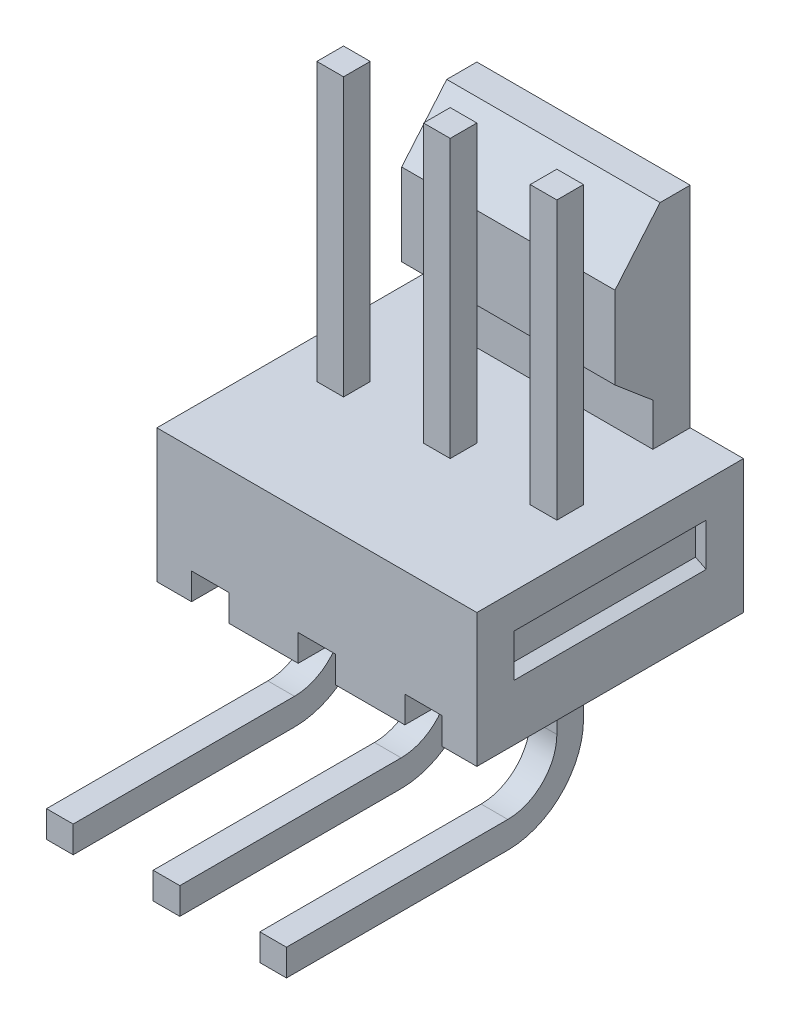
ISO-10303-21;
HEADER;
FILE_DESCRIPTION(('STEP AP214'),'2;1');
FILE_NAME('part.step','',(''),(''),'','','');
FILE_SCHEMA(('AUTOMOTIVE_DESIGN { 1 0 10303 214 1 1 1 1 }'));
ENDSEC;
DATA;
#1=APPLICATION_CONTEXT('core data for automotive mechanical design processes');
#2=APPLICATION_PROTOCOL_DEFINITION('international standard','automotive_design',2000,#1);
#3=PRODUCT_CONTEXT('',#1,'mechanical');
#4=PRODUCT('Part','Part','',(#3));
#5=PRODUCT_RELATED_PRODUCT_CATEGORY('part','',(#4));
#6=PRODUCT_DEFINITION_FORMATION('','',#4);
#7=PRODUCT_DEFINITION_CONTEXT('part definition',#1,'design');
#8=PRODUCT_DEFINITION('design','',#6,#7);
#9=PRODUCT_DEFINITION_SHAPE('','',#8);
#10=(LENGTH_UNIT() NAMED_UNIT(*) SI_UNIT(.MILLI.,.METRE.));
#11=(NAMED_UNIT(*) PLANE_ANGLE_UNIT() SI_UNIT($,.RADIAN.));
#12=(NAMED_UNIT(*) SI_UNIT($,.STERADIAN.) SOLID_ANGLE_UNIT());
#13=UNCERTAINTY_MEASURE_WITH_UNIT(LENGTH_MEASURE(1.E-05),#10,'distance_accuracy_value','');
#14=(GEOMETRIC_REPRESENTATION_CONTEXT(3) GLOBAL_UNCERTAINTY_ASSIGNED_CONTEXT((#13)) GLOBAL_UNIT_ASSIGNED_CONTEXT((#10,
#11,#12)) REPRESENTATION_CONTEXT('',''));
#15=CARTESIAN_POINT('',(0.,0.,0.));
#16=DIRECTION('',(0.,0.,1.));
#17=DIRECTION('',(1.,0.,0.));
#18=AXIS2_PLACEMENT_3D('',#15,#16,#17);
#19=CARTESIAN_POINT('',(-0.3175,-2.8321,1.4859));
#20=DIRECTION('',(1.,0.,0.));
#21=DIRECTION('',(0.,0.,-1.));
#22=AXIS2_PLACEMENT_3D('',#19,#20,#21);
#23=CYLINDRICAL_SURFACE('',#22,1.1684);
#24=CARTESIAN_POINT('',(0.3175,-2.8321,1.4859));
#25=DIRECTION('',(1.,0.,0.));
#26=DIRECTION('',(0.,0.,-1.));
#27=AXIS2_PLACEMENT_3D('',#24,#25,#26);
#28=CIRCLE('',#27,1.1684);
#29=CARTESIAN_POINT('',(0.3175,-2.8321,0.3175));
#30=VERTEX_POINT('',#29);
#31=CARTESIAN_POINT('',(0.3175,-4.0005,1.4859));
#32=VERTEX_POINT('',#31);
#33=EDGE_CURVE('E436',#30,#32,#28,.F.);
#34=ORIENTED_EDGE('',*,*,#33,.F.);
#35=DIRECTION('',(1.,0.,0.));
#36=VECTOR('',#35,1.);
#37=CARTESIAN_POINT('',(-0.3175,-2.8321,0.3175));
#38=LINE('',#37,#36);
#39=CARTESIAN_POINT('',(-0.3175,-2.8321,0.3175));
#40=VERTEX_POINT('',#39);
#41=EDGE_CURVE('E432',#40,#30,#38,.T.);
#42=ORIENTED_EDGE('',*,*,#41,.F.);
#43=CARTESIAN_POINT('',(-0.3175,-2.8321,1.4859));
#44=DIRECTION('',(1.,0.,0.));
#45=DIRECTION('',(0.,0.,-1.));
#46=AXIS2_PLACEMENT_3D('',#43,#44,#45);
#47=CIRCLE('',#46,1.1684);
#48=CARTESIAN_POINT('',(-0.3175,-4.0005,1.4859));
#49=VERTEX_POINT('',#48);
#50=EDGE_CURVE('E20',#40,#49,#47,.F.);
#51=ORIENTED_EDGE('',*,*,#50,.T.);
#52=DIRECTION('',(1.,0.,0.));
#53=VECTOR('',#52,1.);
#54=CARTESIAN_POINT('',(-0.3175,-4.0005,1.4859));
#55=LINE('',#54,#53);
#56=EDGE_CURVE('E441',#32,#49,#55,.F.);
#57=ORIENTED_EDGE('',*,*,#56,.F.);
#58=EDGE_LOOP('',(#34,#42,#51,#57));
#59=FACE_BOUND('',#58,.T.);
#60=ADVANCED_FACE('F17',(#59),#23,.F.);
#61=CARTESIAN_POINT('',(-0.3175,-4.0005,1.4859));
#62=DIRECTION('',(0.,1.,0.));
#63=DIRECTION('',(0.,0.,1.));
#64=AXIS2_PLACEMENT_3D('',#61,#62,#63);
#65=PLANE('',#64);
#66=ORIENTED_EDGE('',*,*,#56,.T.);
#67=DIRECTION('',(0.,0.,-1.));
#68=VECTOR('',#67,1.);
#69=CARTESIAN_POINT('',(-0.3175,-4.0005,3.175));
#70=LINE('',#69,#68);
#71=CARTESIAN_POINT('',(-0.3175,-4.0005,6.7564));
#72=VERTEX_POINT('',#71);
#73=EDGE_CURVE('E452',#49,#72,#70,.F.);
#74=ORIENTED_EDGE('',*,*,#73,.T.);
#75=DIRECTION('',(1.,0.,0.));
#76=VECTOR('',#75,1.);
#77=CARTESIAN_POINT('',(-0.3175,-4.0005,6.7564));
#78=LINE('',#77,#76);
#79=CARTESIAN_POINT('',(0.3175,-4.0005,6.7564));
#80=VERTEX_POINT('',#79);
#81=EDGE_CURVE('E486',#80,#72,#78,.F.);
#82=ORIENTED_EDGE('',*,*,#81,.F.);
#83=DIRECTION('',(0.,0.,-1.));
#84=VECTOR('',#83,1.);
#85=CARTESIAN_POINT('',(0.3175,-4.0005,3.175));
#86=LINE('',#85,#84);
#87=EDGE_CURVE('E493',#32,#80,#86,.F.);
#88=ORIENTED_EDGE('',*,*,#87,.F.);
#89=EDGE_LOOP('',(#66,#74,#82,#88));
#90=FACE_BOUND('',#89,.T.);
#91=ADVANCED_FACE('F558',(#90),#65,.T.);
#92=CARTESIAN_POINT('',(-0.3175,-4.0005,6.7564));
#93=DIRECTION('',(0.,0.,1.));
#94=DIRECTION('',(1.,0.,0.));
#95=AXIS2_PLACEMENT_3D('',#92,#93,#94);
#96=PLANE('',#95);
#97=ORIENTED_EDGE('',*,*,#81,.T.);
#98=DIRECTION('',(0.,1.,0.));
#99=VECTOR('',#98,1.);
#100=CARTESIAN_POINT('',(-0.3175,-0.9525,6.7564));
#101=LINE('',#100,#99);
#102=CARTESIAN_POINT('',(-0.3175,-4.6355,6.7564));
#103=VERTEX_POINT('',#102);
#104=EDGE_CURVE('E501',#72,#103,#101,.F.);
#105=ORIENTED_EDGE('',*,*,#104,.T.);
#106=DIRECTION('',(1.,0.,0.));
#107=VECTOR('',#106,1.);
#108=CARTESIAN_POINT('',(-0.3175,-4.6355,6.7564));
#109=LINE('',#108,#107);
#110=CARTESIAN_POINT('',(0.3175,-4.6355,6.7564));
#111=VERTEX_POINT('',#110);
#112=EDGE_CURVE('E483',#111,#103,#109,.F.);
#113=ORIENTED_EDGE('',*,*,#112,.F.);
#114=DIRECTION('',(0.,1.,0.));
#115=VECTOR('',#114,1.);
#116=CARTESIAN_POINT('',(0.3175,-0.9525,6.7564));
#117=LINE('',#116,#115);
#118=EDGE_CURVE('E489',#80,#111,#117,.F.);
#119=ORIENTED_EDGE('',*,*,#118,.F.);
#120=EDGE_LOOP('',(#97,#105,#113,#119));
#121=FACE_BOUND('',#120,.T.);
#122=ADVANCED_FACE('F562',(#121),#96,.T.);
#123=CARTESIAN_POINT('',(-0.3175,-4.6355,6.7564));
#124=DIRECTION('',(0.,-1.,0.));
#125=DIRECTION('',(0.,0.,-1.));
#126=AXIS2_PLACEMENT_3D('',#123,#124,#125);
#127=PLANE('',#126);
#128=ORIENTED_EDGE('',*,*,#112,.T.);
#129=DIRECTION('',(0.,0.,-1.));
#130=VECTOR('',#129,1.);
#131=CARTESIAN_POINT('',(-0.3175,-4.6355,3.175));
#132=LINE('',#131,#130);
#133=CARTESIAN_POINT('',(-0.3175,-4.6355,1.4859));
#134=VERTEX_POINT('',#133);
#135=EDGE_CURVE('E503',#103,#134,#132,.T.);
#136=ORIENTED_EDGE('',*,*,#135,.T.);
#137=DIRECTION('',(1.,0.,0.));
#138=VECTOR('',#137,1.);
#139=CARTESIAN_POINT('',(-0.3175,-4.6355,1.4859));
#140=LINE('',#139,#138);
#141=CARTESIAN_POINT('',(0.3175,-4.6355,1.4859));
#142=VERTEX_POINT('',#141);
#143=EDGE_CURVE('E477',#142,#134,#140,.F.);
#144=ORIENTED_EDGE('',*,*,#143,.F.);
#145=DIRECTION('',(0.,0.,-1.));
#146=VECTOR('',#145,1.);
#147=CARTESIAN_POINT('',(0.3175,-4.6355,3.175));
#148=LINE('',#147,#146);
#149=EDGE_CURVE('E492',#111,#142,#148,.T.);
#150=ORIENTED_EDGE('',*,*,#149,.F.);
#151=EDGE_LOOP('',(#128,#136,#144,#150));
#152=FACE_BOUND('',#151,.T.);
#153=ADVANCED_FACE('F1703',(#152),#127,.T.);
#154=CARTESIAN_POINT('',(-0.3175,-2.8321,1.4859));
#155=DIRECTION('',(1.,0.,0.));
#156=DIRECTION('',(0.,0.,-1.));
#157=AXIS2_PLACEMENT_3D('',#154,#155,#156);
#158=CYLINDRICAL_SURFACE('',#157,1.8034);
#159=CARTESIAN_POINT('',(0.3175,-2.8321,1.4859));
#160=DIRECTION('',(1.,0.,0.));
#161=DIRECTION('',(0.,0.,-1.));
#162=AXIS2_PLACEMENT_3D('',#159,#160,#161);
#163=CIRCLE('',#162,1.8034);
#164=CARTESIAN_POINT('',(0.3175,-2.8321,-0.3175));
#165=VERTEX_POINT('',#164);
#166=EDGE_CURVE('E542',#142,#165,#163,.T.);
#167=ORIENTED_EDGE('',*,*,#166,.F.);
#168=ORIENTED_EDGE('',*,*,#143,.T.);
#169=CARTESIAN_POINT('',(-0.3175,-2.8321,1.4859));
#170=DIRECTION('',(1.,0.,0.));
#171=DIRECTION('',(0.,0.,-1.));
#172=AXIS2_PLACEMENT_3D('',#169,#170,#171);
#173=CIRCLE('',#172,1.8034);
#174=CARTESIAN_POINT('',(-0.3175,-2.8321,-0.3175));
#175=VERTEX_POINT('',#174);
#176=EDGE_CURVE('E546',#134,#175,#173,.T.);
#177=ORIENTED_EDGE('',*,*,#176,.T.);
#178=DIRECTION('',(-1.,0.,0.));
#179=VECTOR('',#178,1.);
#180=CARTESIAN_POINT('',(-0.3175,-2.8321,-0.3175));
#181=LINE('',#180,#179);
#182=EDGE_CURVE('E474',#165,#175,#181,.T.);
#183=ORIENTED_EDGE('',*,*,#182,.F.);
#184=EDGE_LOOP('',(#167,#168,#177,#183));
#185=FACE_BOUND('',#184,.T.);
#186=ADVANCED_FACE('F571',(#185),#158,.T.);
#187=CARTESIAN_POINT('',(-0.3175,-2.8321,-0.3175));
#188=DIRECTION('',(0.,0.,-1.));
#189=DIRECTION('',(-1.,0.,0.));
#190=AXIS2_PLACEMENT_3D('',#187,#188,#189);
#191=PLANE('',#190);
#192=DIRECTION('',(0.,1.,0.));
#193=VECTOR('',#192,1.);
#194=CARTESIAN_POINT('',(-0.3175,-0.9525,-0.3175));
#195=LINE('',#194,#193);
#196=CARTESIAN_POINT('',(-0.3175,-0.9525,-0.3175));
#197=VERTEX_POINT('',#196);
#198=EDGE_CURVE('E545',#175,#197,#195,.T.);
#199=ORIENTED_EDGE('',*,*,#198,.T.);
#200=DIRECTION('',(-1.,0.,0.));
#201=VECTOR('',#200,1.);
#202=CARTESIAN_POINT('',(-0.3175,-0.9525,-0.3175));
#203=LINE('',#202,#201);
#204=CARTESIAN_POINT('',(0.3175,-0.9525,-0.3175));
#205=VERTEX_POINT('',#204);
#206=EDGE_CURVE('E471',#197,#205,#203,.F.);
#207=ORIENTED_EDGE('',*,*,#206,.T.);
#208=DIRECTION('',(0.,1.,0.));
#209=VECTOR('',#208,1.);
#210=CARTESIAN_POINT('',(0.3175,-0.9525,-0.3175));
#211=LINE('',#210,#209);
#212=EDGE_CURVE('E462',#165,#205,#211,.T.);
#213=ORIENTED_EDGE('',*,*,#212,.F.);
#214=ORIENTED_EDGE('',*,*,#182,.T.);
#215=EDGE_LOOP('',(#199,#207,#213,#214));
#216=FACE_BOUND('',#215,.T.);
#217=ADVANCED_FACE('F566',(#216),#191,.T.);
#218=CARTESIAN_POINT('',(-0.3175,-0.9525,3.175));
#219=DIRECTION('',(1.,0.,0.));
#220=DIRECTION('',(0.,0.,-1.));
#221=AXIS2_PLACEMENT_3D('',#218,#219,#220);
#222=PLANE('',#221);
#223=ORIENTED_EDGE('',*,*,#176,.F.);
#224=ORIENTED_EDGE('',*,*,#135,.F.);
#225=ORIENTED_EDGE('',*,*,#104,.F.);
#226=ORIENTED_EDGE('',*,*,#73,.F.);
#227=ORIENTED_EDGE('',*,*,#50,.F.);
#228=DIRECTION('',(0.,1.,0.));
#229=VECTOR('',#228,1.);
#230=CARTESIAN_POINT('',(-0.3175,-0.9525,0.3175));
#231=LINE('',#230,#229);
#232=CARTESIAN_POINT('',(-0.3175,-0.9525,0.3175));
#233=VERTEX_POINT('',#232);
#234=EDGE_CURVE('E449',#233,#40,#231,.F.);
#235=ORIENTED_EDGE('',*,*,#234,.F.);
#236=DIRECTION('',(0.,0.,-1.));
#237=VECTOR('',#236,1.);
#238=CARTESIAN_POINT('',(-0.3175,-0.9525,3.175));
#239=LINE('',#238,#237);
#240=EDGE_CURVE('E453',#197,#233,#239,.F.);
#241=ORIENTED_EDGE('',*,*,#240,.F.);
#242=ORIENTED_EDGE('',*,*,#198,.F.);
#243=EDGE_LOOP('',(#223,#224,#225,#226,#227,#235,#241,#242));
#244=FACE_BOUND('',#243,.T.);
#245=ADVANCED_FACE('F447',(#244),#222,.F.);
#246=CARTESIAN_POINT('',(0.3175,-0.9525,3.175));
#247=DIRECTION('',(1.,0.,0.));
#248=DIRECTION('',(0.,0.,-1.));
#249=AXIS2_PLACEMENT_3D('',#246,#247,#248);
#250=PLANE('',#249);
#251=ORIENTED_EDGE('',*,*,#212,.T.);
#252=DIRECTION('',(0.,0.,-1.));
#253=VECTOR('',#252,1.);
#254=CARTESIAN_POINT('',(0.3175,-0.9525,3.175));
#255=LINE('',#254,#253);
#256=CARTESIAN_POINT('',(0.3175,-0.9525,0.3175));
#257=VERTEX_POINT('',#256);
#258=EDGE_CURVE('E458',#205,#257,#255,.F.);
#259=ORIENTED_EDGE('',*,*,#258,.T.);
#260=DIRECTION('',(0.,1.,0.));
#261=VECTOR('',#260,1.);
#262=CARTESIAN_POINT('',(0.3175,-0.9525,0.3175));
#263=LINE('',#262,#261);
#264=EDGE_CURVE('E457',#30,#257,#263,.T.);
#265=ORIENTED_EDGE('',*,*,#264,.F.);
#266=ORIENTED_EDGE('',*,*,#33,.T.);
#267=ORIENTED_EDGE('',*,*,#87,.T.);
#268=ORIENTED_EDGE('',*,*,#118,.T.);
#269=ORIENTED_EDGE('',*,*,#149,.T.);
#270=ORIENTED_EDGE('',*,*,#166,.T.);
#271=EDGE_LOOP('',(#251,#259,#265,#266,#267,#268,#269,#270));
#272=FACE_BOUND('',#271,.T.);
#273=ADVANCED_FACE('F575',(#272),#250,.T.);
#274=CARTESIAN_POINT('',(-0.3175,-0.9525,0.3175));
#275=DIRECTION('',(0.,0.,1.));
#276=DIRECTION('',(1.,0.,0.));
#277=AXIS2_PLACEMENT_3D('',#274,#275,#276);
#278=PLANE('',#277);
#279=ORIENTED_EDGE('',*,*,#264,.T.);
#280=DIRECTION('',(1.,0.,0.));
#281=VECTOR('',#280,1.);
#282=CARTESIAN_POINT('',(0.4445,-0.9525,0.3175));
#283=LINE('',#282,#281);
#284=EDGE_CURVE('E456',#257,#233,#283,.F.);
#285=ORIENTED_EDGE('',*,*,#284,.T.);
#286=ORIENTED_EDGE('',*,*,#234,.T.);
#287=ORIENTED_EDGE('',*,*,#41,.T.);
#288=EDGE_LOOP('',(#279,#285,#286,#287));
#289=FACE_BOUND('',#288,.T.);
#290=ADVANCED_FACE('F454',(#289),#278,.T.);
#291=CARTESIAN_POINT('',(0.4445,-0.9525,3.175));
#292=DIRECTION('',(0.,1.,0.));
#293=DIRECTION('',(0.,0.,1.));
#294=AXIS2_PLACEMENT_3D('',#291,#292,#293);
#295=PLANE('',#294);
#296=ORIENTED_EDGE('',*,*,#258,.F.);
#297=ORIENTED_EDGE('',*,*,#206,.F.);
#298=ORIENTED_EDGE('',*,*,#240,.T.);
#299=ORIENTED_EDGE('',*,*,#284,.F.);
#300=EDGE_LOOP('',(#296,#297,#298,#299));
#301=FACE_BOUND('',#300,.T.);
#302=DIRECTION('',(1.,0.,0.));
#303=VECTOR('',#302,1.);
#304=CARTESIAN_POINT('',(0.4445,-0.9525,3.175));
#305=LINE('',#304,#303);
#306=CARTESIAN_POINT('',(-0.4445,-0.9525,3.175));
#307=VERTEX_POINT('',#306);
#308=CARTESIAN_POINT('',(0.4445,-0.9525,3.175));
#309=VERTEX_POINT('',#308);
#310=EDGE_CURVE('E592',#307,#309,#305,.T.);
#311=ORIENTED_EDGE('',*,*,#310,.F.);
#312=DIRECTION('',(0.,0.,1.));
#313=VECTOR('',#312,1.);
#314=CARTESIAN_POINT('',(-0.4445,-0.9525,3.175));
#315=LINE('',#314,#313);
#316=CARTESIAN_POINT('',(-0.4445,-0.9525,-3.175));
#317=VERTEX_POINT('',#316);
#318=EDGE_CURVE('E594',#307,#317,#315,.F.);
#319=ORIENTED_EDGE('',*,*,#318,.T.);
#320=DIRECTION('',(1.,0.,0.));
#321=VECTOR('',#320,1.);
#322=CARTESIAN_POINT('',(0.4445,-0.9525,-3.175));
#323=LINE('',#322,#321);
#324=CARTESIAN_POINT('',(0.4445,-0.9525,-3.175));
#325=VERTEX_POINT('',#324);
#326=EDGE_CURVE('E460',#325,#317,#323,.F.);
#327=ORIENTED_EDGE('',*,*,#326,.F.);
#328=DIRECTION('',(0.,0.,-1.));
#329=VECTOR('',#328,1.);
#330=CARTESIAN_POINT('',(0.4445,-0.9525,3.175));
#331=LINE('',#330,#329);
#332=EDGE_CURVE('E613',#325,#309,#331,.F.);
#333=ORIENTED_EDGE('',*,*,#332,.T.);
#334=EDGE_LOOP('',(#311,#319,#327,#333));
#335=FACE_BOUND('',#334,.T.);
#336=ADVANCED_FACE('F603',(#301,#335),#295,.F.);
#337=CARTESIAN_POINT('',(-0.4445,-0.9525,3.175));
#338=DIRECTION('',(-1.,0.,0.));
#339=DIRECTION('',(0.,0.,1.));
#340=AXIS2_PLACEMENT_3D('',#337,#338,#339);
#341=PLANE('',#340);
#342=ORIENTED_EDGE('',*,*,#318,.F.);
#343=DIRECTION('',(0.,1.,0.));
#344=VECTOR('',#343,1.);
#345=CARTESIAN_POINT('',(-0.4445,-0.9525,3.175));
#346=LINE('',#345,#344);
#347=CARTESIAN_POINT('',(-0.4445,-1.5875,3.175));
#348=VERTEX_POINT('',#347);
#349=EDGE_CURVE('E591',#348,#307,#346,.T.);
#350=ORIENTED_EDGE('',*,*,#349,.F.);
#351=DIRECTION('',(0.,0.,-1.));
#352=VECTOR('',#351,1.);
#353=CARTESIAN_POINT('',(-0.4445,-1.5875,3.175));
#354=LINE('',#353,#352);
#355=CARTESIAN_POINT('',(-0.4445,-1.5875,-3.175));
#356=VERTEX_POINT('',#355);
#357=EDGE_CURVE('E700',#356,#348,#354,.F.);
#358=ORIENTED_EDGE('',*,*,#357,.F.);
#359=DIRECTION('',(0.,1.,0.));
#360=VECTOR('',#359,1.);
#361=CARTESIAN_POINT('',(-0.4445,-0.9525,-3.175));
#362=LINE('',#361,#360);
#363=EDGE_CURVE('E619',#317,#356,#362,.F.);
#364=ORIENTED_EDGE('',*,*,#363,.F.);
#365=EDGE_LOOP('',(#342,#350,#358,#364));
#366=FACE_BOUND('',#365,.T.);
#367=ADVANCED_FACE('F606',(#366),#341,.F.);
#368=CARTESIAN_POINT('',(-2.8575,-2.8321,-0.3175));
#369=DIRECTION('',(0.,0.,-1.));
#370=DIRECTION('',(-1.,0.,0.));
#371=AXIS2_PLACEMENT_3D('',#368,#369,#370);
#372=PLANE('',#371);
#373=DIRECTION('',(1.,0.,0.));
#374=VECTOR('',#373,1.);
#375=CARTESIAN_POINT('',(-2.8575,-2.8321,-0.3175));
#376=LINE('',#375,#374);
#377=CARTESIAN_POINT('',(-2.8575,-2.8321,-0.3175));
#378=VERTEX_POINT('',#377);
#379=CARTESIAN_POINT('',(-2.2225,-2.8321,-0.3175));
#380=VERTEX_POINT('',#379);
#381=EDGE_CURVE('E651',#378,#380,#376,.T.);
#382=ORIENTED_EDGE('',*,*,#381,.F.);
#383=DIRECTION('',(0.,1.,0.));
#384=VECTOR('',#383,1.);
#385=CARTESIAN_POINT('',(-2.8575,-0.9525,-0.3175));
#386=LINE('',#385,#384);
#387=CARTESIAN_POINT('',(-2.8575,-0.9525,-0.3175));
#388=VERTEX_POINT('',#387);
#389=EDGE_CURVE('E724',#378,#388,#386,.T.);
#390=ORIENTED_EDGE('',*,*,#389,.T.);
#391=DIRECTION('',(-1.,0.,0.));
#392=VECTOR('',#391,1.);
#393=CARTESIAN_POINT('',(-2.8575,-0.9525,-0.3175));
#394=LINE('',#393,#392);
#395=CARTESIAN_POINT('',(-2.2225,-0.9525,-0.3175));
#396=VERTEX_POINT('',#395);
#397=EDGE_CURVE('E620',#388,#396,#394,.F.);
#398=ORIENTED_EDGE('',*,*,#397,.T.);
#399=DIRECTION('',(0.,1.,0.));
#400=VECTOR('',#399,1.);
#401=CARTESIAN_POINT('',(-2.2225,-0.9525,-0.3175));
#402=LINE('',#401,#400);
#403=EDGE_CURVE('E535',#380,#396,#402,.T.);
#404=ORIENTED_EDGE('',*,*,#403,.F.);
#405=EDGE_LOOP('',(#382,#390,#398,#404));
#406=FACE_BOUND('',#405,.T.);
#407=ADVANCED_FACE('F1654',(#406),#372,.T.);
#408=CARTESIAN_POINT('',(-2.8575,-2.8321,1.4859));
#409=DIRECTION('',(1.,0.,0.));
#410=DIRECTION('',(0.,0.,-1.));
#411=AXIS2_PLACEMENT_3D('',#408,#409,#410);
#412=CYLINDRICAL_SURFACE('',#411,1.1684);
#413=CARTESIAN_POINT('',(-2.2225,-2.8321,1.4859));
#414=DIRECTION('',(1.,0.,0.));
#415=DIRECTION('',(0.,0.,-1.));
#416=AXIS2_PLACEMENT_3D('',#413,#414,#415);
#417=CIRCLE('',#416,1.1684);
#418=CARTESIAN_POINT('',(-2.2225,-2.8321,0.3175));
#419=VERTEX_POINT('',#418);
#420=CARTESIAN_POINT('',(-2.2225,-4.0005,1.4859));
#421=VERTEX_POINT('',#420);
#422=EDGE_CURVE('E537',#419,#421,#417,.F.);
#423=ORIENTED_EDGE('',*,*,#422,.F.);
#424=DIRECTION('',(1.,0.,0.));
#425=VECTOR('',#424,1.);
#426=CARTESIAN_POINT('',(-2.8575,-2.8321,0.3175));
#427=LINE('',#426,#425);
#428=CARTESIAN_POINT('',(-2.8575,-2.8321,0.3175));
#429=VERTEX_POINT('',#428);
#430=EDGE_CURVE('E632',#429,#419,#427,.T.);
#431=ORIENTED_EDGE('',*,*,#430,.F.);
#432=CARTESIAN_POINT('',(-2.8575,-2.8321,1.4859));
#433=DIRECTION('',(1.,0.,0.));
#434=DIRECTION('',(0.,0.,-1.));
#435=AXIS2_PLACEMENT_3D('',#432,#433,#434);
#436=CIRCLE('',#435,1.1684);
#437=CARTESIAN_POINT('',(-2.8575,-4.0005,1.4859));
#438=VERTEX_POINT('',#437);
#439=EDGE_CURVE('E528',#429,#438,#436,.F.);
#440=ORIENTED_EDGE('',*,*,#439,.T.);
#441=DIRECTION('',(1.,0.,0.));
#442=VECTOR('',#441,1.);
#443=CARTESIAN_POINT('',(-2.8575,-4.0005,1.4859));
#444=LINE('',#443,#442);
#445=EDGE_CURVE('E634',#421,#438,#444,.F.);
#446=ORIENTED_EDGE('',*,*,#445,.F.);
#447=EDGE_LOOP('',(#423,#431,#440,#446));
#448=FACE_BOUND('',#447,.T.);
#449=ADVANCED_FACE('F1646',(#448),#412,.F.);
#450=CARTESIAN_POINT('',(-2.8575,-4.0005,1.4859));
#451=DIRECTION('',(0.,1.,0.));
#452=DIRECTION('',(0.,0.,1.));
#453=AXIS2_PLACEMENT_3D('',#450,#451,#452);
#454=PLANE('',#453);
#455=ORIENTED_EDGE('',*,*,#445,.T.);
#456=DIRECTION('',(0.,0.,-1.));
#457=VECTOR('',#456,1.);
#458=CARTESIAN_POINT('',(-2.8575,-4.0005,3.175));
#459=LINE('',#458,#457);
#460=CARTESIAN_POINT('',(-2.8575,-4.0005,6.7564));
#461=VERTEX_POINT('',#460);
#462=EDGE_CURVE('E530',#438,#461,#459,.F.);
#463=ORIENTED_EDGE('',*,*,#462,.T.);
#464=DIRECTION('',(1.,0.,0.));
#465=VECTOR('',#464,1.);
#466=CARTESIAN_POINT('',(-2.8575,-4.0005,6.7564));
#467=LINE('',#466,#465);
#468=CARTESIAN_POINT('',(-2.2225,-4.0005,6.7564));
#469=VERTEX_POINT('',#468);
#470=EDGE_CURVE('E637',#469,#461,#467,.F.);
#471=ORIENTED_EDGE('',*,*,#470,.F.);
#472=DIRECTION('',(0.,0.,-1.));
#473=VECTOR('',#472,1.);
#474=CARTESIAN_POINT('',(-2.2225,-4.0005,3.175));
#475=LINE('',#474,#473);
#476=EDGE_CURVE('E540',#421,#469,#475,.F.);
#477=ORIENTED_EDGE('',*,*,#476,.F.);
#478=EDGE_LOOP('',(#455,#463,#471,#477));
#479=FACE_BOUND('',#478,.T.);
#480=ADVANCED_FACE('F1638',(#479),#454,.T.);
#481=CARTESIAN_POINT('',(-2.8575,-4.0005,6.7564));
#482=DIRECTION('',(0.,0.,1.));
#483=DIRECTION('',(1.,0.,0.));
#484=AXIS2_PLACEMENT_3D('',#481,#482,#483);
#485=PLANE('',#484);
#486=ORIENTED_EDGE('',*,*,#470,.T.);
#487=DIRECTION('',(0.,1.,0.));
#488=VECTOR('',#487,1.);
#489=CARTESIAN_POINT('',(-2.8575,-0.9525,6.7564));
#490=LINE('',#489,#488);
#491=CARTESIAN_POINT('',(-2.8575,-4.6355,6.7564));
#492=VERTEX_POINT('',#491);
#493=EDGE_CURVE('E645',#461,#492,#490,.F.);
#494=ORIENTED_EDGE('',*,*,#493,.T.);
#495=DIRECTION('',(1.,0.,0.));
#496=VECTOR('',#495,1.);
#497=CARTESIAN_POINT('',(-2.8575,-4.6355,6.7564));
#498=LINE('',#497,#496);
#499=CARTESIAN_POINT('',(-2.2225,-4.6355,6.7564));
#500=VERTEX_POINT('',#499);
#501=EDGE_CURVE('E642',#500,#492,#498,.F.);
#502=ORIENTED_EDGE('',*,*,#501,.F.);
#503=DIRECTION('',(0.,1.,0.));
#504=VECTOR('',#503,1.);
#505=CARTESIAN_POINT('',(-2.2225,-0.9525,6.7564));
#506=LINE('',#505,#504);
#507=EDGE_CURVE('E625',#469,#500,#506,.F.);
#508=ORIENTED_EDGE('',*,*,#507,.F.);
#509=EDGE_LOOP('',(#486,#494,#502,#508));
#510=FACE_BOUND('',#509,.T.);
#511=ADVANCED_FACE('F1630',(#510),#485,.T.);
#512=CARTESIAN_POINT('',(-2.8575,-4.6355,6.7564));
#513=DIRECTION('',(0.,-1.,0.));
#514=DIRECTION('',(0.,0.,-1.));
#515=AXIS2_PLACEMENT_3D('',#512,#513,#514);
#516=PLANE('',#515);
#517=ORIENTED_EDGE('',*,*,#501,.T.);
#518=DIRECTION('',(0.,0.,-1.));
#519=VECTOR('',#518,1.);
#520=CARTESIAN_POINT('',(-2.8575,-4.6355,3.175));
#521=LINE('',#520,#519);
#522=CARTESIAN_POINT('',(-2.8575,-4.6355,1.4859));
#523=VERTEX_POINT('',#522);
#524=EDGE_CURVE('E527',#492,#523,#521,.T.);
#525=ORIENTED_EDGE('',*,*,#524,.T.);
#526=DIRECTION('',(1.,0.,0.));
#527=VECTOR('',#526,1.);
#528=CARTESIAN_POINT('',(-2.8575,-4.6355,1.4859));
#529=LINE('',#528,#527);
#530=CARTESIAN_POINT('',(-2.2225,-4.6355,1.4859));
#531=VERTEX_POINT('',#530);
#532=EDGE_CURVE('E653',#531,#523,#529,.F.);
#533=ORIENTED_EDGE('',*,*,#532,.F.);
#534=DIRECTION('',(0.,0.,-1.));
#535=VECTOR('',#534,1.);
#536=CARTESIAN_POINT('',(-2.2225,-4.6355,3.175));
#537=LINE('',#536,#535);
#538=EDGE_CURVE('E536',#500,#531,#537,.T.);
#539=ORIENTED_EDGE('',*,*,#538,.F.);
#540=EDGE_LOOP('',(#517,#525,#533,#539));
#541=FACE_BOUND('',#540,.T.);
#542=ADVANCED_FACE('F1144',(#541),#516,.T.);
#543=CARTESIAN_POINT('',(-2.8575,-2.8321,1.4859));
#544=DIRECTION('',(1.,0.,0.));
#545=DIRECTION('',(0.,0.,-1.));
#546=AXIS2_PLACEMENT_3D('',#543,#544,#545);
#547=CYLINDRICAL_SURFACE('',#546,1.8034);
#548=CARTESIAN_POINT('',(-2.2225,-2.8321,1.4859));
#549=DIRECTION('',(1.,0.,0.));
#550=DIRECTION('',(0.,0.,-1.));
#551=AXIS2_PLACEMENT_3D('',#548,#549,#550);
#552=CIRCLE('',#551,1.8034);
#553=EDGE_CURVE('E532',#531,#380,#552,.T.);
#554=ORIENTED_EDGE('',*,*,#553,.F.);
#555=ORIENTED_EDGE('',*,*,#532,.T.);
#556=CARTESIAN_POINT('',(-2.8575,-2.8321,1.4859));
#557=DIRECTION('',(1.,0.,0.));
#558=DIRECTION('',(0.,0.,-1.));
#559=AXIS2_PLACEMENT_3D('',#556,#557,#558);
#560=CIRCLE('',#559,1.8034);
#561=EDGE_CURVE('E523',#523,#378,#560,.T.);
#562=ORIENTED_EDGE('',*,*,#561,.T.);
#563=ORIENTED_EDGE('',*,*,#381,.T.);
#564=EDGE_LOOP('',(#554,#555,#562,#563));
#565=FACE_BOUND('',#564,.T.);
#566=ADVANCED_FACE('F1134',(#565),#547,.T.);
#567=CARTESIAN_POINT('',(0.4445,-1.5875,3.175));
#568=DIRECTION('',(1.,0.,0.));
#569=DIRECTION('',(0.,0.,-1.));
#570=AXIS2_PLACEMENT_3D('',#567,#568,#569);
#571=PLANE('',#570);
#572=ORIENTED_EDGE('',*,*,#332,.F.);
#573=DIRECTION('',(0.,1.,0.));
#574=VECTOR('',#573,1.);
#575=CARTESIAN_POINT('',(0.4445,-1.5875,-3.175));
#576=LINE('',#575,#574);
#577=CARTESIAN_POINT('',(0.4445,-1.5875,-3.175));
#578=VERTEX_POINT('',#577);
#579=EDGE_CURVE('E656',#578,#325,#576,.T.);
#580=ORIENTED_EDGE('',*,*,#579,.F.);
#581=DIRECTION('',(0.,0.,-1.));
#582=VECTOR('',#581,1.);
#583=CARTESIAN_POINT('',(0.4445,-1.5875,3.175));
#584=LINE('',#583,#582);
#585=CARTESIAN_POINT('',(0.4445,-1.5875,3.175));
#586=VERTEX_POINT('',#585);
#587=EDGE_CURVE('E752',#586,#578,#584,.T.);
#588=ORIENTED_EDGE('',*,*,#587,.F.);
#589=DIRECTION('',(0.,1.,0.));
#590=VECTOR('',#589,1.);
#591=CARTESIAN_POINT('',(0.4445,-1.5875,3.175));
#592=LINE('',#591,#590);
#593=EDGE_CURVE('E659',#309,#586,#592,.F.);
#594=ORIENTED_EDGE('',*,*,#593,.F.);
#595=EDGE_LOOP('',(#572,#580,#588,#594));
#596=FACE_BOUND('',#595,.T.);
#597=ADVANCED_FACE('F1131',(#596),#571,.F.);
#598=CARTESIAN_POINT('',(2.2225,-2.8321,1.4859));
#599=DIRECTION('',(1.,0.,0.));
#600=DIRECTION('',(0.,0.,-1.));
#601=AXIS2_PLACEMENT_3D('',#598,#599,#600);
#602=CYLINDRICAL_SURFACE('',#601,1.1684);
#603=CARTESIAN_POINT('',(2.8575,-2.8321,1.4859));
#604=DIRECTION('',(1.,0.,0.));
#605=DIRECTION('',(0.,0.,-1.));
#606=AXIS2_PLACEMENT_3D('',#603,#604,#605);
#607=CIRCLE('',#606,1.1684);
#608=CARTESIAN_POINT('',(2.8575,-2.8321,0.3175));
#609=VERTEX_POINT('',#608);
#610=CARTESIAN_POINT('',(2.8575,-4.0005,1.4859));
#611=VERTEX_POINT('',#610);
#612=EDGE_CURVE('E511',#609,#611,#607,.F.);
#613=ORIENTED_EDGE('',*,*,#612,.F.);
#614=DIRECTION('',(1.,0.,0.));
#615=VECTOR('',#614,1.);
#616=CARTESIAN_POINT('',(2.2225,-2.8321,0.3175));
#617=LINE('',#616,#615);
#618=CARTESIAN_POINT('',(2.2225,-2.8321,0.3175));
#619=VERTEX_POINT('',#618);
#620=EDGE_CURVE('E661',#619,#609,#617,.T.);
#621=ORIENTED_EDGE('',*,*,#620,.F.);
#622=CARTESIAN_POINT('',(2.2225,-2.8321,1.4859));
#623=DIRECTION('',(1.,0.,0.));
#624=DIRECTION('',(0.,0.,-1.));
#625=AXIS2_PLACEMENT_3D('',#622,#623,#624);
#626=CIRCLE('',#625,1.1684);
#627=CARTESIAN_POINT('',(2.2225,-4.0005,1.4859));
#628=VERTEX_POINT('',#627);
#629=EDGE_CURVE('E519',#619,#628,#626,.F.);
#630=ORIENTED_EDGE('',*,*,#629,.T.);
#631=DIRECTION('',(1.,0.,0.));
#632=VECTOR('',#631,1.);
#633=CARTESIAN_POINT('',(2.2225,-4.0005,1.4859));
#634=LINE('',#633,#632);
#635=EDGE_CURVE('E667',#611,#628,#634,.F.);
#636=ORIENTED_EDGE('',*,*,#635,.F.);
#637=EDGE_LOOP('',(#613,#621,#630,#636));
#638=FACE_BOUND('',#637,.T.);
#639=ADVANCED_FACE('F1133',(#638),#602,.F.);
#640=CARTESIAN_POINT('',(2.2225,-4.0005,1.4859));
#641=DIRECTION('',(0.,1.,0.));
#642=DIRECTION('',(0.,0.,1.));
#643=AXIS2_PLACEMENT_3D('',#640,#641,#642);
#644=PLANE('',#643);
#645=ORIENTED_EDGE('',*,*,#635,.T.);
#646=DIRECTION('',(0.,0.,-1.));
#647=VECTOR('',#646,1.);
#648=CARTESIAN_POINT('',(2.2225,-4.0005,3.175));
#649=LINE('',#648,#647);
#650=CARTESIAN_POINT('',(2.2225,-4.0005,6.7564));
#651=VERTEX_POINT('',#650);
#652=EDGE_CURVE('E521',#628,#651,#649,.F.);
#653=ORIENTED_EDGE('',*,*,#652,.T.);
#654=DIRECTION('',(1.,0.,0.));
#655=VECTOR('',#654,1.);
#656=CARTESIAN_POINT('',(2.2225,-4.0005,6.7564));
#657=LINE('',#656,#655);
#658=CARTESIAN_POINT('',(2.8575,-4.0005,6.7564));
#659=VERTEX_POINT('',#658);
#660=EDGE_CURVE('E670',#659,#651,#657,.F.);
#661=ORIENTED_EDGE('',*,*,#660,.F.);
#662=DIRECTION('',(0.,0.,-1.));
#663=VECTOR('',#662,1.);
#664=CARTESIAN_POINT('',(2.8575,-4.0005,3.175));
#665=LINE('',#664,#663);
#666=EDGE_CURVE('E514',#611,#659,#665,.F.);
#667=ORIENTED_EDGE('',*,*,#666,.F.);
#668=EDGE_LOOP('',(#645,#653,#661,#667));
#669=FACE_BOUND('',#668,.T.);
#670=ADVANCED_FACE('F1141',(#669),#644,.T.);
#671=CARTESIAN_POINT('',(2.2225,-4.0005,6.7564));
#672=DIRECTION('',(0.,0.,1.));
#673=DIRECTION('',(1.,0.,0.));
#674=AXIS2_PLACEMENT_3D('',#671,#672,#673);
#675=PLANE('',#674);
#676=ORIENTED_EDGE('',*,*,#660,.T.);
#677=DIRECTION('',(0.,1.,0.));
#678=VECTOR('',#677,1.);
#679=CARTESIAN_POINT('',(2.2225,-0.9525,6.7564));
#680=LINE('',#679,#678);
#681=CARTESIAN_POINT('',(2.2225,-4.6355,6.7564));
#682=VERTEX_POINT('',#681);
#683=EDGE_CURVE('E664',#651,#682,#680,.F.);
#684=ORIENTED_EDGE('',*,*,#683,.T.);
#685=DIRECTION('',(1.,0.,0.));
#686=VECTOR('',#685,1.);
#687=CARTESIAN_POINT('',(2.2225,-4.6355,6.7564));
#688=LINE('',#687,#686);
#689=CARTESIAN_POINT('',(2.8575,-4.6355,6.7564));
#690=VERTEX_POINT('',#689);
#691=EDGE_CURVE('E675',#690,#682,#688,.F.);
#692=ORIENTED_EDGE('',*,*,#691,.F.);
#693=DIRECTION('',(0.,1.,0.));
#694=VECTOR('',#693,1.);
#695=CARTESIAN_POINT('',(2.8575,-0.9525,6.7564));
#696=LINE('',#695,#694);
#697=EDGE_CURVE('E678',#659,#690,#696,.F.);
#698=ORIENTED_EDGE('',*,*,#697,.F.);
#699=EDGE_LOOP('',(#676,#684,#692,#698));
#700=FACE_BOUND('',#699,.T.);
#701=ADVANCED_FACE('F1356',(#700),#675,.T.);
#702=CARTESIAN_POINT('',(2.2225,-4.6355,6.7564));
#703=DIRECTION('',(0.,-1.,0.));
#704=DIRECTION('',(0.,0.,-1.));
#705=AXIS2_PLACEMENT_3D('',#702,#703,#704);
#706=PLANE('',#705);
#707=ORIENTED_EDGE('',*,*,#691,.T.);
#708=DIRECTION('',(0.,0.,-1.));
#709=VECTOR('',#708,1.);
#710=CARTESIAN_POINT('',(2.2225,-4.6355,3.175));
#711=LINE('',#710,#709);
#712=CARTESIAN_POINT('',(2.2225,-4.6355,1.4859));
#713=VERTEX_POINT('',#712);
#714=EDGE_CURVE('E518',#682,#713,#711,.T.);
#715=ORIENTED_EDGE('',*,*,#714,.T.);
#716=DIRECTION('',(1.,0.,0.));
#717=VECTOR('',#716,1.);
#718=CARTESIAN_POINT('',(2.2225,-4.6355,1.4859));
#719=LINE('',#718,#717);
#720=CARTESIAN_POINT('',(2.8575,-4.6355,1.4859));
#721=VERTEX_POINT('',#720);
#722=EDGE_CURVE('E685',#721,#713,#719,.F.);
#723=ORIENTED_EDGE('',*,*,#722,.F.);
#724=DIRECTION('',(0.,0.,-1.));
#725=VECTOR('',#724,1.);
#726=CARTESIAN_POINT('',(2.8575,-4.6355,3.175));
#727=LINE('',#726,#725);
#728=EDGE_CURVE('E510',#690,#721,#727,.T.);
#729=ORIENTED_EDGE('',*,*,#728,.F.);
#730=EDGE_LOOP('',(#707,#715,#723,#729));
#731=FACE_BOUND('',#730,.T.);
#732=ADVANCED_FACE('F1352',(#731),#706,.T.);
#733=CARTESIAN_POINT('',(2.2225,-2.8321,1.4859));
#734=DIRECTION('',(1.,0.,0.));
#735=DIRECTION('',(0.,0.,-1.));
#736=AXIS2_PLACEMENT_3D('',#733,#734,#735);
#737=CYLINDRICAL_SURFACE('',#736,1.8034);
#738=CARTESIAN_POINT('',(2.8575,-2.8321,1.4859));
#739=DIRECTION('',(1.,0.,0.));
#740=DIRECTION('',(0.,0.,-1.));
#741=AXIS2_PLACEMENT_3D('',#738,#739,#740);
#742=CIRCLE('',#741,1.8034);
#743=CARTESIAN_POINT('',(2.8575,-2.8321,-0.3175));
#744=VERTEX_POINT('',#743);
#745=EDGE_CURVE('E506',#721,#744,#742,.T.);
#746=ORIENTED_EDGE('',*,*,#745,.F.);
#747=ORIENTED_EDGE('',*,*,#722,.T.);
#748=CARTESIAN_POINT('',(2.2225,-2.8321,1.4859));
#749=DIRECTION('',(1.,0.,0.));
#750=DIRECTION('',(0.,0.,-1.));
#751=AXIS2_PLACEMENT_3D('',#748,#749,#750);
#752=CIRCLE('',#751,1.8034);
#753=CARTESIAN_POINT('',(2.2225,-2.8321,-0.3175));
#754=VERTEX_POINT('',#753);
#755=EDGE_CURVE('E516',#713,#754,#752,.T.);
#756=ORIENTED_EDGE('',*,*,#755,.T.);
#757=DIRECTION('',(-1.,0.,0.));
#758=VECTOR('',#757,1.);
#759=CARTESIAN_POINT('',(2.2225,-2.8321,-0.3175));
#760=LINE('',#759,#758);
#761=EDGE_CURVE('E688',#744,#754,#760,.T.);
#762=ORIENTED_EDGE('',*,*,#761,.F.);
#763=EDGE_LOOP('',(#746,#747,#756,#762));
#764=FACE_BOUND('',#763,.T.);
#765=ADVANCED_FACE('F1348',(#764),#737,.T.);
#766=CARTESIAN_POINT('',(2.2225,-2.8321,-0.3175));
#767=DIRECTION('',(0.,0.,-1.));
#768=DIRECTION('',(-1.,0.,0.));
#769=AXIS2_PLACEMENT_3D('',#766,#767,#768);
#770=PLANE('',#769);
#771=DIRECTION('',(0.,1.,0.));
#772=VECTOR('',#771,1.);
#773=CARTESIAN_POINT('',(2.2225,-0.9525,-0.3175));
#774=LINE('',#773,#772);
#775=CARTESIAN_POINT('',(2.2225,-0.9525,-0.3175));
#776=VERTEX_POINT('',#775);
#777=EDGE_CURVE('E515',#754,#776,#774,.T.);
#778=ORIENTED_EDGE('',*,*,#777,.T.);
#779=DIRECTION('',(-1.,0.,0.));
#780=VECTOR('',#779,1.);
#781=CARTESIAN_POINT('',(2.2225,-0.9525,-0.3175));
#782=LINE('',#781,#780);
#783=CARTESIAN_POINT('',(2.8575,-0.9525,-0.3175));
#784=VERTEX_POINT('',#783);
#785=EDGE_CURVE('E691',#776,#784,#782,.F.);
#786=ORIENTED_EDGE('',*,*,#785,.T.);
#787=DIRECTION('',(0.,1.,0.));
#788=VECTOR('',#787,1.);
#789=CARTESIAN_POINT('',(2.8575,-0.9525,-0.3175));
#790=LINE('',#789,#788);
#791=EDGE_CURVE('E509',#744,#784,#790,.T.);
#792=ORIENTED_EDGE('',*,*,#791,.F.);
#793=ORIENTED_EDGE('',*,*,#761,.T.);
#794=EDGE_LOOP('',(#778,#786,#792,#793));
#795=FACE_BOUND('',#794,.T.);
#796=ADVANCED_FACE('F1344',(#795),#770,.T.);
#797=CARTESIAN_POINT('',(-3.81,-1.5875,3.175));
#798=DIRECTION('',(0.,-1.,0.));
#799=DIRECTION('',(0.,0.,-1.));
#800=AXIS2_PLACEMENT_3D('',#797,#798,#799);
#801=PLANE('',#800);
#802=DIRECTION('',(1.,0.,0.));
#803=VECTOR('',#802,1.);
#804=CARTESIAN_POINT('',(-3.81,-1.5875,-3.175));
#805=LINE('',#804,#803);
#806=CARTESIAN_POINT('',(-2.0955,-1.5875,-3.175));
#807=VERTEX_POINT('',#806);
#808=EDGE_CURVE('E697',#807,#356,#805,.T.);
#809=ORIENTED_EDGE('',*,*,#808,.T.);
#810=ORIENTED_EDGE('',*,*,#357,.T.);
#811=DIRECTION('',(1.,0.,0.));
#812=VECTOR('',#811,1.);
#813=CARTESIAN_POINT('',(-3.81,-1.5875,3.175));
#814=LINE('',#813,#812);
#815=CARTESIAN_POINT('',(-2.0955,-1.5875,3.175));
#816=VERTEX_POINT('',#815);
#817=EDGE_CURVE('E693',#348,#816,#814,.F.);
#818=ORIENTED_EDGE('',*,*,#817,.T.);
#819=DIRECTION('',(0.,0.,-1.));
#820=VECTOR('',#819,1.);
#821=CARTESIAN_POINT('',(-2.0955,-1.5875,3.175));
#822=LINE('',#821,#820);
#823=EDGE_CURVE('E788',#816,#807,#822,.T.);
#824=ORIENTED_EDGE('',*,*,#823,.T.);
#825=EDGE_LOOP('',(#809,#810,#818,#824));
#826=FACE_BOUND('',#825,.T.);
#827=ADVANCED_FACE('F1340',(#826),#801,.T.);
#828=CARTESIAN_POINT('',(-2.2225,-0.9525,3.175));
#829=DIRECTION('',(1.,0.,0.));
#830=DIRECTION('',(0.,0.,-1.));
#831=AXIS2_PLACEMENT_3D('',#828,#829,#830);
#832=PLANE('',#831);
#833=ORIENTED_EDGE('',*,*,#553,.T.);
#834=ORIENTED_EDGE('',*,*,#403,.T.);
#835=DIRECTION('',(0.,0.,-1.));
#836=VECTOR('',#835,1.);
#837=CARTESIAN_POINT('',(-2.2225,-0.9525,3.175));
#838=LINE('',#837,#836);
#839=CARTESIAN_POINT('',(-2.2225,-0.9525,0.3175));
#840=VERTEX_POINT('',#839);
#841=EDGE_CURVE('E541',#396,#840,#838,.F.);
#842=ORIENTED_EDGE('',*,*,#841,.T.);
#843=DIRECTION('',(0.,1.,0.));
#844=VECTOR('',#843,1.);
#845=CARTESIAN_POINT('',(-2.2225,-0.9525,0.3175));
#846=LINE('',#845,#844);
#847=EDGE_CURVE('E707',#419,#840,#846,.T.);
#848=ORIENTED_EDGE('',*,*,#847,.F.);
#849=ORIENTED_EDGE('',*,*,#422,.T.);
#850=ORIENTED_EDGE('',*,*,#476,.T.);
#851=ORIENTED_EDGE('',*,*,#507,.T.);
#852=ORIENTED_EDGE('',*,*,#538,.T.);
#853=EDGE_LOOP('',(#833,#834,#842,#848,#849,#850,#851,#852));
#854=FACE_BOUND('',#853,.T.);
#855=ADVANCED_FACE('F1336',(#854),#832,.T.);
#856=CARTESIAN_POINT('',(-2.8575,-0.9525,3.175));
#857=DIRECTION('',(1.,0.,0.));
#858=DIRECTION('',(0.,0.,-1.));
#859=AXIS2_PLACEMENT_3D('',#856,#857,#858);
#860=PLANE('',#859);
#861=ORIENTED_EDGE('',*,*,#524,.F.);
#862=ORIENTED_EDGE('',*,*,#493,.F.);
#863=ORIENTED_EDGE('',*,*,#462,.F.);
#864=ORIENTED_EDGE('',*,*,#439,.F.);
#865=DIRECTION('',(0.,1.,0.));
#866=VECTOR('',#865,1.);
#867=CARTESIAN_POINT('',(-2.8575,-0.9525,0.3175));
#868=LINE('',#867,#866);
#869=CARTESIAN_POINT('',(-2.8575,-0.9525,0.3175));
#870=VERTEX_POINT('',#869);
#871=EDGE_CURVE('E710',#870,#429,#868,.F.);
#872=ORIENTED_EDGE('',*,*,#871,.F.);
#873=DIRECTION('',(0.,0.,-1.));
#874=VECTOR('',#873,1.);
#875=CARTESIAN_POINT('',(-2.8575,-0.9525,3.175));
#876=LINE('',#875,#874);
#877=EDGE_CURVE('E531',#388,#870,#876,.F.);
#878=ORIENTED_EDGE('',*,*,#877,.F.);
#879=ORIENTED_EDGE('',*,*,#389,.F.);
#880=ORIENTED_EDGE('',*,*,#561,.F.);
#881=EDGE_LOOP('',(#861,#862,#863,#864,#872,#878,#879,#880));
#882=FACE_BOUND('',#881,.T.);
#883=ADVANCED_FACE('F1333',(#882),#860,.F.);
#884=CARTESIAN_POINT('',(-3.81,-1.5875,3.175));
#885=DIRECTION('',(0.,-1.,0.));
#886=DIRECTION('',(0.,0.,-1.));
#887=AXIS2_PLACEMENT_3D('',#884,#885,#886);
#888=PLANE('',#887);
#889=DIRECTION('',(1.,0.,0.));
#890=VECTOR('',#889,1.);
#891=CARTESIAN_POINT('',(-3.81,-1.5875,-3.175));
#892=LINE('',#891,#890);
#893=CARTESIAN_POINT('',(2.0955,-1.5875,-3.175));
#894=VERTEX_POINT('',#893);
#895=EDGE_CURVE('E755',#578,#894,#892,.T.);
#896=ORIENTED_EDGE('',*,*,#895,.T.);
#897=DIRECTION('',(0.,0.,1.));
#898=VECTOR('',#897,1.);
#899=CARTESIAN_POINT('',(2.0955,-1.5875,3.175));
#900=LINE('',#899,#898);
#901=CARTESIAN_POINT('',(2.0955,-1.5875,3.175));
#902=VERTEX_POINT('',#901);
#903=EDGE_CURVE('E739',#894,#902,#900,.T.);
#904=ORIENTED_EDGE('',*,*,#903,.T.);
#905=DIRECTION('',(1.,0.,0.));
#906=VECTOR('',#905,1.);
#907=CARTESIAN_POINT('',(-3.81,-1.5875,3.175));
#908=LINE('',#907,#906);
#909=EDGE_CURVE('E526',#902,#586,#908,.F.);
#910=ORIENTED_EDGE('',*,*,#909,.T.);
#911=ORIENTED_EDGE('',*,*,#587,.T.);
#912=EDGE_LOOP('',(#896,#904,#910,#911));
#913=FACE_BOUND('',#912,.T.);
#914=ADVANCED_FACE('F1128',(#913),#888,.T.);
#915=CARTESIAN_POINT('',(2.2225,-0.9525,3.175));
#916=DIRECTION('',(1.,0.,0.));
#917=DIRECTION('',(0.,0.,-1.));
#918=AXIS2_PLACEMENT_3D('',#915,#916,#917);
#919=PLANE('',#918);
#920=ORIENTED_EDGE('',*,*,#755,.F.);
#921=ORIENTED_EDGE('',*,*,#714,.F.);
#922=ORIENTED_EDGE('',*,*,#683,.F.);
#923=ORIENTED_EDGE('',*,*,#652,.F.);
#924=ORIENTED_EDGE('',*,*,#629,.F.);
#925=DIRECTION('',(0.,1.,0.));
#926=VECTOR('',#925,1.);
#927=CARTESIAN_POINT('',(2.2225,-0.9525,0.3175));
#928=LINE('',#927,#926);
#929=CARTESIAN_POINT('',(2.2225,-0.9525,0.3175));
#930=VERTEX_POINT('',#929);
#931=EDGE_CURVE('E762',#930,#619,#928,.F.);
#932=ORIENTED_EDGE('',*,*,#931,.F.);
#933=DIRECTION('',(0.,0.,-1.));
#934=VECTOR('',#933,1.);
#935=CARTESIAN_POINT('',(2.2225,-0.9525,3.175));
#936=LINE('',#935,#934);
#937=EDGE_CURVE('E522',#776,#930,#936,.F.);
#938=ORIENTED_EDGE('',*,*,#937,.F.);
#939=ORIENTED_EDGE('',*,*,#777,.F.);
#940=EDGE_LOOP('',(#920,#921,#922,#923,#924,#932,#938,#939));
#941=FACE_BOUND('',#940,.T.);
#942=ADVANCED_FACE('F1326',(#941),#919,.F.);
#943=CARTESIAN_POINT('',(2.8575,-0.9525,3.175));
#944=DIRECTION('',(1.,0.,0.));
#945=DIRECTION('',(0.,0.,-1.));
#946=AXIS2_PLACEMENT_3D('',#943,#944,#945);
#947=PLANE('',#946);
#948=ORIENTED_EDGE('',*,*,#791,.T.);
#949=DIRECTION('',(0.,0.,-1.));
#950=VECTOR('',#949,1.);
#951=CARTESIAN_POINT('',(2.8575,-0.9525,3.175));
#952=LINE('',#951,#950);
#953=CARTESIAN_POINT('',(2.8575,-0.9525,0.3175));
#954=VERTEX_POINT('',#953);
#955=EDGE_CURVE('E786',#784,#954,#952,.F.);
#956=ORIENTED_EDGE('',*,*,#955,.T.);
#957=DIRECTION('',(0.,1.,0.));
#958=VECTOR('',#957,1.);
#959=CARTESIAN_POINT('',(2.8575,-0.9525,0.3175));
#960=LINE('',#959,#958);
#961=EDGE_CURVE('E765',#609,#954,#960,.T.);
#962=ORIENTED_EDGE('',*,*,#961,.F.);
#963=ORIENTED_EDGE('',*,*,#612,.T.);
#964=ORIENTED_EDGE('',*,*,#666,.T.);
#965=ORIENTED_EDGE('',*,*,#697,.T.);
#966=ORIENTED_EDGE('',*,*,#728,.T.);
#967=ORIENTED_EDGE('',*,*,#745,.T.);
#968=EDGE_LOOP('',(#948,#956,#962,#963,#964,#965,#966,#967));
#969=FACE_BOUND('',#968,.T.);
#970=ADVANCED_FACE('F1322',(#969),#947,.T.);
#971=CARTESIAN_POINT('',(-2.0955,-1.5875,3.175));
#972=DIRECTION('',(1.,0.,0.));
#973=DIRECTION('',(0.,0.,-1.));
#974=AXIS2_PLACEMENT_3D('',#971,#972,#973);
#975=PLANE('',#974);
#976=DIRECTION('',(0.,0.,1.));
#977=VECTOR('',#976,1.);
#978=CARTESIAN_POINT('',(-2.0955,-0.9525,3.175));
#979=LINE('',#978,#977);
#980=CARTESIAN_POINT('',(-2.0955,-0.9525,3.175));
#981=VERTEX_POINT('',#980);
#982=CARTESIAN_POINT('',(-2.0955,-0.9525,-3.175));
#983=VERTEX_POINT('',#982);
#984=EDGE_CURVE('E731',#981,#983,#979,.F.);
#985=ORIENTED_EDGE('',*,*,#984,.T.);
#986=DIRECTION('',(0.,1.,0.));
#987=VECTOR('',#986,1.);
#988=CARTESIAN_POINT('',(-2.0955,-1.5875,-3.175));
#989=LINE('',#988,#987);
#990=EDGE_CURVE('E808',#807,#983,#989,.T.);
#991=ORIENTED_EDGE('',*,*,#990,.F.);
#992=ORIENTED_EDGE('',*,*,#823,.F.);
#993=DIRECTION('',(0.,1.,0.));
#994=VECTOR('',#993,1.);
#995=CARTESIAN_POINT('',(-2.0955,-1.5875,3.175));
#996=LINE('',#995,#994);
#997=EDGE_CURVE('E711',#981,#816,#996,.F.);
#998=ORIENTED_EDGE('',*,*,#997,.F.);
#999=EDGE_LOOP('',(#985,#991,#992,#998));
#1000=FACE_BOUND('',#999,.T.);
#1001=ADVANCED_FACE('F1318',(#1000),#975,.F.);
#1002=CARTESIAN_POINT('',(-2.8575,-0.9525,0.3175));
#1003=DIRECTION('',(0.,0.,1.));
#1004=DIRECTION('',(1.,0.,0.));
#1005=AXIS2_PLACEMENT_3D('',#1002,#1003,#1004);
#1006=PLANE('',#1005);
#1007=DIRECTION('',(1.,0.,0.));
#1008=VECTOR('',#1007,1.);
#1009=CARTESIAN_POINT('',(-2.0955,-0.9525,0.3175));
#1010=LINE('',#1009,#1008);
#1011=EDGE_CURVE('E727',#840,#870,#1010,.F.);
#1012=ORIENTED_EDGE('',*,*,#1011,.T.);
#1013=ORIENTED_EDGE('',*,*,#871,.T.);
#1014=ORIENTED_EDGE('',*,*,#430,.T.);
#1015=ORIENTED_EDGE('',*,*,#847,.T.);
#1016=EDGE_LOOP('',(#1012,#1013,#1014,#1015));
#1017=FACE_BOUND('',#1016,.T.);
#1018=ADVANCED_FACE('F1315',(#1017),#1006,.T.);
#1019=CARTESIAN_POINT('',(2.0955,-0.9525,3.175));
#1020=DIRECTION('',(-1.,0.,0.));
#1021=DIRECTION('',(0.,0.,1.));
#1022=AXIS2_PLACEMENT_3D('',#1019,#1020,#1021);
#1023=PLANE('',#1022);
#1024=DIRECTION('',(0.,0.,1.));
#1025=VECTOR('',#1024,1.);
#1026=CARTESIAN_POINT('',(2.0955,-0.9525,3.175));
#1027=LINE('',#1026,#1025);
#1028=CARTESIAN_POINT('',(2.0955,-0.9525,-3.175));
#1029=VERTEX_POINT('',#1028);
#1030=CARTESIAN_POINT('',(2.0955,-0.9525,3.175));
#1031=VERTEX_POINT('',#1030);
#1032=EDGE_CURVE('E830',#1029,#1031,#1027,.T.);
#1033=ORIENTED_EDGE('',*,*,#1032,.T.);
#1034=DIRECTION('',(0.,1.,0.));
#1035=VECTOR('',#1034,1.);
#1036=CARTESIAN_POINT('',(2.0955,-0.9525,3.175));
#1037=LINE('',#1036,#1035);
#1038=EDGE_CURVE('E814',#902,#1031,#1037,.T.);
#1039=ORIENTED_EDGE('',*,*,#1038,.F.);
#1040=ORIENTED_EDGE('',*,*,#903,.F.);
#1041=DIRECTION('',(0.,1.,0.));
#1042=VECTOR('',#1041,1.);
#1043=CARTESIAN_POINT('',(2.0955,-0.9525,-3.175));
#1044=LINE('',#1043,#1042);
#1045=EDGE_CURVE('E766',#1029,#894,#1044,.F.);
#1046=ORIENTED_EDGE('',*,*,#1045,.F.);
#1047=EDGE_LOOP('',(#1033,#1039,#1040,#1046));
#1048=FACE_BOUND('',#1047,.T.);
#1049=ADVANCED_FACE('F1126',(#1048),#1023,.F.);
#1050=CARTESIAN_POINT('',(2.2225,-0.9525,0.3175));
#1051=DIRECTION('',(0.,0.,1.));
#1052=DIRECTION('',(1.,0.,0.));
#1053=AXIS2_PLACEMENT_3D('',#1050,#1051,#1052);
#1054=PLANE('',#1053);
#1055=ORIENTED_EDGE('',*,*,#961,.T.);
#1056=DIRECTION('',(1.,0.,0.));
#1057=VECTOR('',#1056,1.);
#1058=CARTESIAN_POINT('',(2.9845,-0.9525,0.3175));
#1059=LINE('',#1058,#1057);
#1060=EDGE_CURVE('E779',#954,#930,#1059,.F.);
#1061=ORIENTED_EDGE('',*,*,#1060,.T.);
#1062=ORIENTED_EDGE('',*,*,#931,.T.);
#1063=ORIENTED_EDGE('',*,*,#620,.T.);
#1064=EDGE_LOOP('',(#1055,#1061,#1062,#1063));
#1065=FACE_BOUND('',#1064,.T.);
#1066=ADVANCED_FACE('F1308',(#1065),#1054,.T.);
#1067=CARTESIAN_POINT('',(-2.2225,-0.9525,3.175));
#1068=DIRECTION('',(1.,0.,0.));
#1069=DIRECTION('',(0.,0.,-1.));
#1070=AXIS2_PLACEMENT_3D('',#1067,#1068,#1069);
#1071=PLANE('',#1070);
#1072=DIRECTION('',(0.,1.,0.));
#1073=VECTOR('',#1072,1.);
#1074=CARTESIAN_POINT('',(-2.2225,8.1915,0.3175));
#1075=LINE('',#1074,#1073);
#1076=CARTESIAN_POINT('',(-2.2225,1.5875,0.3175));
#1077=VERTEX_POINT('',#1076);
#1078=CARTESIAN_POINT('',(-2.2225,8.1915,0.3175));
#1079=VERTEX_POINT('',#1078);
#1080=EDGE_CURVE('E844',#1077,#1079,#1075,.T.);
#1081=ORIENTED_EDGE('',*,*,#1080,.F.);
#1082=DIRECTION('',(0.,0.,-1.));
#1083=VECTOR('',#1082,1.);
#1084=CARTESIAN_POINT('',(-2.2225,1.5875,3.175));
#1085=LINE('',#1084,#1083);
#1086=CARTESIAN_POINT('',(-2.2225,1.5875,-0.3175));
#1087=VERTEX_POINT('',#1086);
#1088=EDGE_CURVE('E793',#1077,#1087,#1085,.T.);
#1089=ORIENTED_EDGE('',*,*,#1088,.T.);
#1090=DIRECTION('',(0.,1.,0.));
#1091=VECTOR('',#1090,1.);
#1092=CARTESIAN_POINT('',(-2.2225,1.5875,-0.3175));
#1093=LINE('',#1092,#1091);
#1094=CARTESIAN_POINT('',(-2.2225,8.1915,-0.3175));
#1095=VERTEX_POINT('',#1094);
#1096=EDGE_CURVE('E782',#1095,#1087,#1093,.F.);
#1097=ORIENTED_EDGE('',*,*,#1096,.F.);
#1098=DIRECTION('',(0.,0.,1.));
#1099=VECTOR('',#1098,1.);
#1100=CARTESIAN_POINT('',(-2.2225,8.1915,-0.3175));
#1101=LINE('',#1100,#1099);
#1102=EDGE_CURVE('E838',#1079,#1095,#1101,.F.);
#1103=ORIENTED_EDGE('',*,*,#1102,.F.);
#1104=EDGE_LOOP('',(#1081,#1089,#1097,#1103));
#1105=FACE_BOUND('',#1104,.T.);
#1106=ADVANCED_FACE('F1304',(#1105),#1071,.T.);
#1107=CARTESIAN_POINT('',(0.3175,-0.9525,3.175));
#1108=DIRECTION('',(1.,0.,0.));
#1109=DIRECTION('',(0.,0.,-1.));
#1110=AXIS2_PLACEMENT_3D('',#1107,#1108,#1109);
#1111=PLANE('',#1110);
#1112=DIRECTION('',(0.,1.,0.));
#1113=VECTOR('',#1112,1.);
#1114=CARTESIAN_POINT('',(0.3175,8.1915,0.3175));
#1115=LINE('',#1114,#1113);
#1116=CARTESIAN_POINT('',(0.3175,1.5875,0.3175));
#1117=VERTEX_POINT('',#1116);
#1118=CARTESIAN_POINT('',(0.3175,8.1915,0.3175));
#1119=VERTEX_POINT('',#1118);
#1120=EDGE_CURVE('E864',#1117,#1119,#1115,.T.);
#1121=ORIENTED_EDGE('',*,*,#1120,.F.);
#1122=DIRECTION('',(0.,0.,-1.));
#1123=VECTOR('',#1122,1.);
#1124=CARTESIAN_POINT('',(0.3175,1.5875,3.175));
#1125=LINE('',#1124,#1123);
#1126=CARTESIAN_POINT('',(0.3175,1.5875,-0.3175));
#1127=VERTEX_POINT('',#1126);
#1128=EDGE_CURVE('E819',#1117,#1127,#1125,.T.);
#1129=ORIENTED_EDGE('',*,*,#1128,.T.);
#1130=DIRECTION('',(0.,1.,0.));
#1131=VECTOR('',#1130,1.);
#1132=CARTESIAN_POINT('',(0.3175,1.5875,-0.3175));
#1133=LINE('',#1132,#1131);
#1134=CARTESIAN_POINT('',(0.3175,8.1915,-0.3175));
#1135=VERTEX_POINT('',#1134);
#1136=EDGE_CURVE('E853',#1135,#1127,#1133,.F.);
#1137=ORIENTED_EDGE('',*,*,#1136,.F.);
#1138=DIRECTION('',(0.,0.,1.));
#1139=VECTOR('',#1138,1.);
#1140=CARTESIAN_POINT('',(0.3175,8.1915,-0.3175));
#1141=LINE('',#1140,#1139);
#1142=EDGE_CURVE('E858',#1119,#1135,#1141,.F.);
#1143=ORIENTED_EDGE('',*,*,#1142,.F.);
#1144=EDGE_LOOP('',(#1121,#1129,#1137,#1143));
#1145=FACE_BOUND('',#1144,.T.);
#1146=ADVANCED_FACE('F1300',(#1145),#1111,.T.);
#1147=CARTESIAN_POINT('',(2.8575,-0.9525,3.175));
#1148=DIRECTION('',(1.,0.,0.));
#1149=DIRECTION('',(0.,0.,-1.));
#1150=AXIS2_PLACEMENT_3D('',#1147,#1148,#1149);
#1151=PLANE('',#1150);
#1152=DIRECTION('',(0.,1.,0.));
#1153=VECTOR('',#1152,1.);
#1154=CARTESIAN_POINT('',(2.8575,8.1915,0.3175));
#1155=LINE('',#1154,#1153);
#1156=CARTESIAN_POINT('',(2.8575,1.5875,0.3175));
#1157=VERTEX_POINT('',#1156);
#1158=CARTESIAN_POINT('',(2.8575,8.1915,0.3175));
#1159=VERTEX_POINT('',#1158);
#1160=EDGE_CURVE('E884',#1157,#1159,#1155,.T.);
#1161=ORIENTED_EDGE('',*,*,#1160,.F.);
#1162=DIRECTION('',(0.,0.,-1.));
#1163=VECTOR('',#1162,1.);
#1164=CARTESIAN_POINT('',(2.8575,1.5875,3.175));
#1165=LINE('',#1164,#1163);
#1166=CARTESIAN_POINT('',(2.8575,1.5875,-0.3175));
#1167=VERTEX_POINT('',#1166);
#1168=EDGE_CURVE('E821',#1157,#1167,#1165,.T.);
#1169=ORIENTED_EDGE('',*,*,#1168,.T.);
#1170=DIRECTION('',(0.,1.,0.));
#1171=VECTOR('',#1170,1.);
#1172=CARTESIAN_POINT('',(2.8575,1.5875,-0.3175));
#1173=LINE('',#1172,#1171);
#1174=CARTESIAN_POINT('',(2.8575,8.1915,-0.3175));
#1175=VERTEX_POINT('',#1174);
#1176=EDGE_CURVE('E873',#1175,#1167,#1173,.F.);
#1177=ORIENTED_EDGE('',*,*,#1176,.F.);
#1178=DIRECTION('',(0.,0.,1.));
#1179=VECTOR('',#1178,1.);
#1180=CARTESIAN_POINT('',(2.8575,8.1915,-0.3175));
#1181=LINE('',#1180,#1179);
#1182=EDGE_CURVE('E878',#1159,#1175,#1181,.F.);
#1183=ORIENTED_EDGE('',*,*,#1182,.F.);
#1184=EDGE_LOOP('',(#1161,#1169,#1177,#1183));
#1185=FACE_BOUND('',#1184,.T.);
#1186=ADVANCED_FACE('F1296',(#1185),#1151,.T.);
#1187=CARTESIAN_POINT('',(-2.0955,-0.9525,3.175));
#1188=DIRECTION('',(0.,1.,0.));
#1189=DIRECTION('',(0.,0.,1.));
#1190=AXIS2_PLACEMENT_3D('',#1187,#1188,#1189);
#1191=PLANE('',#1190);
#1192=ORIENTED_EDGE('',*,*,#841,.F.);
#1193=ORIENTED_EDGE('',*,*,#397,.F.);
#1194=ORIENTED_EDGE('',*,*,#877,.T.);
#1195=ORIENTED_EDGE('',*,*,#1011,.F.);
#1196=EDGE_LOOP('',(#1192,#1193,#1194,#1195));
#1197=FACE_BOUND('',#1196,.T.);
#1198=DIRECTION('',(1.,0.,0.));
#1199=VECTOR('',#1198,1.);
#1200=CARTESIAN_POINT('',(-2.0955,-0.9525,3.175));
#1201=LINE('',#1200,#1199);
#1202=CARTESIAN_POINT('',(-2.9845,-0.9525,3.175));
#1203=VERTEX_POINT('',#1202);
#1204=EDGE_CURVE('E825',#1203,#981,#1201,.T.);
#1205=ORIENTED_EDGE('',*,*,#1204,.F.);
#1206=DIRECTION('',(0.,0.,1.));
#1207=VECTOR('',#1206,1.);
#1208=CARTESIAN_POINT('',(-2.9845,-0.9525,3.175));
#1209=LINE('',#1208,#1207);
#1210=CARTESIAN_POINT('',(-2.9845,-0.9525,-3.175));
#1211=VERTEX_POINT('',#1210);
#1212=EDGE_CURVE('E895',#1203,#1211,#1209,.F.);
#1213=ORIENTED_EDGE('',*,*,#1212,.T.);
#1214=DIRECTION('',(1.,0.,0.));
#1215=VECTOR('',#1214,1.);
#1216=CARTESIAN_POINT('',(-2.0955,-0.9525,-3.175));
#1217=LINE('',#1216,#1215);
#1218=EDGE_CURVE('E823',#983,#1211,#1217,.F.);
#1219=ORIENTED_EDGE('',*,*,#1218,.F.);
#1220=ORIENTED_EDGE('',*,*,#984,.F.);
#1221=EDGE_LOOP('',(#1205,#1213,#1219,#1220));
#1222=FACE_BOUND('',#1221,.T.);
#1223=ADVANCED_FACE('F1292',(#1197,#1222),#1191,.F.);
#1224=CARTESIAN_POINT('',(2.9845,-0.9525,3.175));
#1225=DIRECTION('',(0.,1.,0.));
#1226=DIRECTION('',(0.,0.,1.));
#1227=AXIS2_PLACEMENT_3D('',#1224,#1225,#1226);
#1228=PLANE('',#1227);
#1229=ORIENTED_EDGE('',*,*,#955,.F.);
#1230=ORIENTED_EDGE('',*,*,#785,.F.);
#1231=ORIENTED_EDGE('',*,*,#937,.T.);
#1232=ORIENTED_EDGE('',*,*,#1060,.F.);
#1233=EDGE_LOOP('',(#1229,#1230,#1231,#1232));
#1234=FACE_BOUND('',#1233,.T.);
#1235=DIRECTION('',(1.,0.,0.));
#1236=VECTOR('',#1235,1.);
#1237=CARTESIAN_POINT('',(2.9845,-0.9525,3.175));
#1238=LINE('',#1237,#1236);
#1239=CARTESIAN_POINT('',(2.9845,-0.9525,3.175));
#1240=VERTEX_POINT('',#1239);
#1241=EDGE_CURVE('E783',#1031,#1240,#1238,.T.);
#1242=ORIENTED_EDGE('',*,*,#1241,.F.);
#1243=ORIENTED_EDGE('',*,*,#1032,.F.);
#1244=DIRECTION('',(1.,0.,0.));
#1245=VECTOR('',#1244,1.);
#1246=CARTESIAN_POINT('',(2.9845,-0.9525,-3.175));
#1247=LINE('',#1246,#1245);
#1248=CARTESIAN_POINT('',(2.9845,-0.9525,-3.175));
#1249=VERTEX_POINT('',#1248);
#1250=EDGE_CURVE('E730',#1249,#1029,#1247,.F.);
#1251=ORIENTED_EDGE('',*,*,#1250,.F.);
#1252=DIRECTION('',(0.,0.,-1.));
#1253=VECTOR('',#1252,1.);
#1254=CARTESIAN_POINT('',(2.9845,-0.9525,3.175));
#1255=LINE('',#1254,#1253);
#1256=EDGE_CURVE('E906',#1249,#1240,#1255,.F.);
#1257=ORIENTED_EDGE('',*,*,#1256,.T.);
#1258=EDGE_LOOP('',(#1242,#1243,#1251,#1257));
#1259=FACE_BOUND('',#1258,.T.);
#1260=ADVANCED_FACE('F1121',(#1234,#1259),#1228,.F.);
#1261=CARTESIAN_POINT('',(-2.8575,1.5875,-0.3175));
#1262=DIRECTION('',(0.,0.,-1.));
#1263=DIRECTION('',(-1.,0.,0.));
#1264=AXIS2_PLACEMENT_3D('',#1261,#1262,#1263);
#1265=PLANE('',#1264);
#1266=ORIENTED_EDGE('',*,*,#1096,.T.);
#1267=DIRECTION('',(-1.,0.,0.));
#1268=VECTOR('',#1267,1.);
#1269=CARTESIAN_POINT('',(-2.8575,1.5875,-0.3175));
#1270=LINE('',#1269,#1268);
#1271=CARTESIAN_POINT('',(-2.8575,1.5875,-0.3175));
#1272=VERTEX_POINT('',#1271);
#1273=EDGE_CURVE('E836',#1087,#1272,#1270,.T.);
#1274=ORIENTED_EDGE('',*,*,#1273,.T.);
#1275=DIRECTION('',(0.,1.,0.));
#1276=VECTOR('',#1275,1.);
#1277=CARTESIAN_POINT('',(-2.8575,-0.9525,-0.3175));
#1278=LINE('',#1277,#1276);
#1279=CARTESIAN_POINT('',(-2.8575,8.1915,-0.3175));
#1280=VERTEX_POINT('',#1279);
#1281=EDGE_CURVE('E919',#1272,#1280,#1278,.T.);
#1282=ORIENTED_EDGE('',*,*,#1281,.T.);
#1283=DIRECTION('',(1.,0.,0.));
#1284=VECTOR('',#1283,1.);
#1285=CARTESIAN_POINT('',(-2.8575,8.1915,-0.3175));
#1286=LINE('',#1285,#1284);
#1287=EDGE_CURVE('E841',#1095,#1280,#1286,.F.);
#1288=ORIENTED_EDGE('',*,*,#1287,.F.);
#1289=EDGE_LOOP('',(#1266,#1274,#1282,#1288));
#1290=FACE_BOUND('',#1289,.T.);
#1291=ADVANCED_FACE('F1285',(#1290),#1265,.T.);
#1292=CARTESIAN_POINT('',(-2.8575,8.1915,-0.3175));
#1293=DIRECTION('',(0.,1.,0.));
#1294=DIRECTION('',(0.,0.,1.));
#1295=AXIS2_PLACEMENT_3D('',#1292,#1293,#1294);
#1296=PLANE('',#1295);
#1297=ORIENTED_EDGE('',*,*,#1287,.T.);
#1298=DIRECTION('',(0.,0.,-1.));
#1299=VECTOR('',#1298,1.);
#1300=CARTESIAN_POINT('',(-2.8575,8.1915,3.175));
#1301=LINE('',#1300,#1299);
#1302=CARTESIAN_POINT('',(-2.8575,8.1915,0.3175));
#1303=VERTEX_POINT('',#1302);
#1304=EDGE_CURVE('E921',#1280,#1303,#1301,.F.);
#1305=ORIENTED_EDGE('',*,*,#1304,.T.);
#1306=DIRECTION('',(1.,0.,0.));
#1307=VECTOR('',#1306,1.);
#1308=CARTESIAN_POINT('',(-2.8575,8.1915,0.3175));
#1309=LINE('',#1308,#1307);
#1310=EDGE_CURVE('E847',#1079,#1303,#1309,.F.);
#1311=ORIENTED_EDGE('',*,*,#1310,.F.);
#1312=ORIENTED_EDGE('',*,*,#1102,.T.);
#1313=EDGE_LOOP('',(#1297,#1305,#1311,#1312));
#1314=FACE_BOUND('',#1313,.T.);
#1315=ADVANCED_FACE('F1281',(#1314),#1296,.T.);
#1316=CARTESIAN_POINT('',(-2.8575,8.1915,0.3175));
#1317=DIRECTION('',(0.,0.,1.));
#1318=DIRECTION('',(1.,0.,0.));
#1319=AXIS2_PLACEMENT_3D('',#1316,#1317,#1318);
#1320=PLANE('',#1319);
#1321=DIRECTION('',(0.,1.,0.));
#1322=VECTOR('',#1321,1.);
#1323=CARTESIAN_POINT('',(-2.8575,-0.9525,0.3175));
#1324=LINE('',#1323,#1322);
#1325=CARTESIAN_POINT('',(-2.8575,1.5875,0.3175));
#1326=VERTEX_POINT('',#1325);
#1327=EDGE_CURVE('E923',#1303,#1326,#1324,.F.);
#1328=ORIENTED_EDGE('',*,*,#1327,.T.);
#1329=DIRECTION('',(1.,0.,0.));
#1330=VECTOR('',#1329,1.);
#1331=CARTESIAN_POINT('',(-2.8575,1.5875,0.3175));
#1332=LINE('',#1331,#1330);
#1333=EDGE_CURVE('E850',#1326,#1077,#1332,.T.);
#1334=ORIENTED_EDGE('',*,*,#1333,.T.);
#1335=ORIENTED_EDGE('',*,*,#1080,.T.);
#1336=ORIENTED_EDGE('',*,*,#1310,.T.);
#1337=EDGE_LOOP('',(#1328,#1334,#1335,#1336));
#1338=FACE_BOUND('',#1337,.T.);
#1339=ADVANCED_FACE('F1277',(#1338),#1320,.T.);
#1340=CARTESIAN_POINT('',(-0.3175,1.5875,-0.3175));
#1341=DIRECTION('',(0.,0.,-1.));
#1342=DIRECTION('',(-1.,0.,0.));
#1343=AXIS2_PLACEMENT_3D('',#1340,#1341,#1342);
#1344=PLANE('',#1343);
#1345=ORIENTED_EDGE('',*,*,#1136,.T.);
#1346=DIRECTION('',(-1.,0.,0.));
#1347=VECTOR('',#1346,1.);
#1348=CARTESIAN_POINT('',(-0.3175,1.5875,-0.3175));
#1349=LINE('',#1348,#1347);
#1350=CARTESIAN_POINT('',(-0.3175,1.5875,-0.3175));
#1351=VERTEX_POINT('',#1350);
#1352=EDGE_CURVE('E856',#1127,#1351,#1349,.T.);
#1353=ORIENTED_EDGE('',*,*,#1352,.T.);
#1354=DIRECTION('',(0.,1.,0.));
#1355=VECTOR('',#1354,1.);
#1356=CARTESIAN_POINT('',(-0.3175,-0.9525,-0.3175));
#1357=LINE('',#1356,#1355);
#1358=CARTESIAN_POINT('',(-0.3175,8.1915,-0.3175));
#1359=VERTEX_POINT('',#1358);
#1360=EDGE_CURVE('E926',#1351,#1359,#1357,.T.);
#1361=ORIENTED_EDGE('',*,*,#1360,.T.);
#1362=DIRECTION('',(1.,0.,0.));
#1363=VECTOR('',#1362,1.);
#1364=CARTESIAN_POINT('',(-0.3175,8.1915,-0.3175));
#1365=LINE('',#1364,#1363);
#1366=EDGE_CURVE('E861',#1135,#1359,#1365,.F.);
#1367=ORIENTED_EDGE('',*,*,#1366,.F.);
#1368=EDGE_LOOP('',(#1345,#1353,#1361,#1367));
#1369=FACE_BOUND('',#1368,.T.);
#1370=ADVANCED_FACE('F1273',(#1369),#1344,.T.);
#1371=CARTESIAN_POINT('',(-0.3175,8.1915,-0.3175));
#1372=DIRECTION('',(0.,1.,0.));
#1373=DIRECTION('',(0.,0.,1.));
#1374=AXIS2_PLACEMENT_3D('',#1371,#1372,#1373);
#1375=PLANE('',#1374);
#1376=ORIENTED_EDGE('',*,*,#1366,.T.);
#1377=DIRECTION('',(0.,0.,-1.));
#1378=VECTOR('',#1377,1.);
#1379=CARTESIAN_POINT('',(-0.3175,8.1915,3.175));
#1380=LINE('',#1379,#1378);
#1381=CARTESIAN_POINT('',(-0.3175,8.1915,0.3175));
#1382=VERTEX_POINT('',#1381);
#1383=EDGE_CURVE('E928',#1359,#1382,#1380,.F.);
#1384=ORIENTED_EDGE('',*,*,#1383,.T.);
#1385=DIRECTION('',(1.,0.,0.));
#1386=VECTOR('',#1385,1.);
#1387=CARTESIAN_POINT('',(-0.3175,8.1915,0.3175));
#1388=LINE('',#1387,#1386);
#1389=EDGE_CURVE('E867',#1119,#1382,#1388,.F.);
#1390=ORIENTED_EDGE('',*,*,#1389,.F.);
#1391=ORIENTED_EDGE('',*,*,#1142,.T.);
#1392=EDGE_LOOP('',(#1376,#1384,#1390,#1391));
#1393=FACE_BOUND('',#1392,.T.);
#1394=ADVANCED_FACE('F1269',(#1393),#1375,.T.);
#1395=CARTESIAN_POINT('',(-0.3175,8.1915,0.3175));
#1396=DIRECTION('',(0.,0.,1.));
#1397=DIRECTION('',(1.,0.,0.));
#1398=AXIS2_PLACEMENT_3D('',#1395,#1396,#1397);
#1399=PLANE('',#1398);
#1400=DIRECTION('',(0.,1.,0.));
#1401=VECTOR('',#1400,1.);
#1402=CARTESIAN_POINT('',(-0.3175,-0.9525,0.3175));
#1403=LINE('',#1402,#1401);
#1404=CARTESIAN_POINT('',(-0.3175,1.5875,0.3175));
#1405=VERTEX_POINT('',#1404);
#1406=EDGE_CURVE('E930',#1382,#1405,#1403,.F.);
#1407=ORIENTED_EDGE('',*,*,#1406,.T.);
#1408=DIRECTION('',(1.,0.,0.));
#1409=VECTOR('',#1408,1.);
#1410=CARTESIAN_POINT('',(-0.3175,1.5875,0.3175));
#1411=LINE('',#1410,#1409);
#1412=EDGE_CURVE('E870',#1405,#1117,#1411,.T.);
#1413=ORIENTED_EDGE('',*,*,#1412,.T.);
#1414=ORIENTED_EDGE('',*,*,#1120,.T.);
#1415=ORIENTED_EDGE('',*,*,#1389,.T.);
#1416=EDGE_LOOP('',(#1407,#1413,#1414,#1415));
#1417=FACE_BOUND('',#1416,.T.);
#1418=ADVANCED_FACE('F1265',(#1417),#1399,.T.);
#1419=CARTESIAN_POINT('',(2.2225,1.5875,-0.3175));
#1420=DIRECTION('',(0.,0.,-1.));
#1421=DIRECTION('',(-1.,0.,0.));
#1422=AXIS2_PLACEMENT_3D('',#1419,#1420,#1421);
#1423=PLANE('',#1422);
#1424=ORIENTED_EDGE('',*,*,#1176,.T.);
#1425=DIRECTION('',(-1.,0.,0.));
#1426=VECTOR('',#1425,1.);
#1427=CARTESIAN_POINT('',(2.2225,1.5875,-0.3175));
#1428=LINE('',#1427,#1426);
#1429=CARTESIAN_POINT('',(2.2225,1.5875,-0.3175));
#1430=VERTEX_POINT('',#1429);
#1431=EDGE_CURVE('E876',#1167,#1430,#1428,.T.);
#1432=ORIENTED_EDGE('',*,*,#1431,.T.);
#1433=DIRECTION('',(0.,1.,0.));
#1434=VECTOR('',#1433,1.);
#1435=CARTESIAN_POINT('',(2.2225,-0.9525,-0.3175));
#1436=LINE('',#1435,#1434);
#1437=CARTESIAN_POINT('',(2.2225,8.1915,-0.3175));
#1438=VERTEX_POINT('',#1437);
#1439=EDGE_CURVE('E933',#1430,#1438,#1436,.T.);
#1440=ORIENTED_EDGE('',*,*,#1439,.T.);
#1441=DIRECTION('',(1.,0.,0.));
#1442=VECTOR('',#1441,1.);
#1443=CARTESIAN_POINT('',(2.2225,8.1915,-0.3175));
#1444=LINE('',#1443,#1442);
#1445=EDGE_CURVE('E881',#1175,#1438,#1444,.F.);
#1446=ORIENTED_EDGE('',*,*,#1445,.F.);
#1447=EDGE_LOOP('',(#1424,#1432,#1440,#1446));
#1448=FACE_BOUND('',#1447,.T.);
#1449=ADVANCED_FACE('F1261',(#1448),#1423,.T.);
#1450=CARTESIAN_POINT('',(2.2225,8.1915,-0.3175));
#1451=DIRECTION('',(0.,1.,0.));
#1452=DIRECTION('',(0.,0.,1.));
#1453=AXIS2_PLACEMENT_3D('',#1450,#1451,#1452);
#1454=PLANE('',#1453);
#1455=ORIENTED_EDGE('',*,*,#1445,.T.);
#1456=DIRECTION('',(0.,0.,-1.));
#1457=VECTOR('',#1456,1.);
#1458=CARTESIAN_POINT('',(2.2225,8.1915,3.175));
#1459=LINE('',#1458,#1457);
#1460=CARTESIAN_POINT('',(2.2225,8.1915,0.3175));
#1461=VERTEX_POINT('',#1460);
#1462=EDGE_CURVE('E935',#1438,#1461,#1459,.F.);
#1463=ORIENTED_EDGE('',*,*,#1462,.T.);
#1464=DIRECTION('',(1.,0.,0.));
#1465=VECTOR('',#1464,1.);
#1466=CARTESIAN_POINT('',(2.2225,8.1915,0.3175));
#1467=LINE('',#1466,#1465);
#1468=EDGE_CURVE('E887',#1159,#1461,#1467,.F.);
#1469=ORIENTED_EDGE('',*,*,#1468,.F.);
#1470=ORIENTED_EDGE('',*,*,#1182,.T.);
#1471=EDGE_LOOP('',(#1455,#1463,#1469,#1470));
#1472=FACE_BOUND('',#1471,.T.);
#1473=ADVANCED_FACE('F1257',(#1472),#1454,.T.);
#1474=CARTESIAN_POINT('',(2.2225,8.1915,0.3175));
#1475=DIRECTION('',(0.,0.,1.));
#1476=DIRECTION('',(1.,0.,0.));
#1477=AXIS2_PLACEMENT_3D('',#1474,#1475,#1476);
#1478=PLANE('',#1477);
#1479=DIRECTION('',(0.,1.,0.));
#1480=VECTOR('',#1479,1.);
#1481=CARTESIAN_POINT('',(2.2225,-0.9525,0.3175));
#1482=LINE('',#1481,#1480);
#1483=CARTESIAN_POINT('',(2.2225,1.5875,0.3175));
#1484=VERTEX_POINT('',#1483);
#1485=EDGE_CURVE('E937',#1461,#1484,#1482,.F.);
#1486=ORIENTED_EDGE('',*,*,#1485,.T.);
#1487=DIRECTION('',(1.,0.,0.));
#1488=VECTOR('',#1487,1.);
#1489=CARTESIAN_POINT('',(2.2225,1.5875,0.3175));
#1490=LINE('',#1489,#1488);
#1491=EDGE_CURVE('E890',#1484,#1157,#1490,.T.);
#1492=ORIENTED_EDGE('',*,*,#1491,.T.);
#1493=ORIENTED_EDGE('',*,*,#1160,.T.);
#1494=ORIENTED_EDGE('',*,*,#1468,.T.);
#1495=EDGE_LOOP('',(#1486,#1492,#1493,#1494));
#1496=FACE_BOUND('',#1495,.T.);
#1497=ADVANCED_FACE('F1253',(#1496),#1478,.T.);
#1498=CARTESIAN_POINT('',(-2.9845,-0.9525,3.175));
#1499=DIRECTION('',(-1.,0.,0.));
#1500=DIRECTION('',(0.,0.,1.));
#1501=AXIS2_PLACEMENT_3D('',#1498,#1499,#1500);
#1502=PLANE('',#1501);
#1503=ORIENTED_EDGE('',*,*,#1212,.F.);
#1504=DIRECTION('',(0.,1.,0.));
#1505=VECTOR('',#1504,1.);
#1506=CARTESIAN_POINT('',(-2.9845,-0.9525,3.175));
#1507=LINE('',#1506,#1505);
#1508=CARTESIAN_POINT('',(-2.9845,-1.5875,3.175));
#1509=VERTEX_POINT('',#1508);
#1510=EDGE_CURVE('E893',#1509,#1203,#1507,.T.);
#1511=ORIENTED_EDGE('',*,*,#1510,.F.);
#1512=DIRECTION('',(0.,0.,-1.));
#1513=VECTOR('',#1512,1.);
#1514=CARTESIAN_POINT('',(-2.9845,-1.5875,3.175));
#1515=LINE('',#1514,#1513);
#1516=CARTESIAN_POINT('',(-2.9845,-1.5875,-3.175));
#1517=VERTEX_POINT('',#1516);
#1518=EDGE_CURVE('E945',#1517,#1509,#1515,.F.);
#1519=ORIENTED_EDGE('',*,*,#1518,.F.);
#1520=DIRECTION('',(0.,1.,0.));
#1521=VECTOR('',#1520,1.);
#1522=CARTESIAN_POINT('',(-2.9845,-0.9525,-3.175));
#1523=LINE('',#1522,#1521);
#1524=EDGE_CURVE('E898',#1211,#1517,#1523,.F.);
#1525=ORIENTED_EDGE('',*,*,#1524,.F.);
#1526=EDGE_LOOP('',(#1503,#1511,#1519,#1525));
#1527=FACE_BOUND('',#1526,.T.);
#1528=ADVANCED_FACE('F1249',(#1527),#1502,.F.);
#1529=CARTESIAN_POINT('',(-3.556,-0.127,-2.286));
#1530=DIRECTION('',(1.,0.,0.));
#1531=DIRECTION('',(0.,0.,-1.));
#1532=AXIS2_PLACEMENT_3D('',#1529,#1530,#1531);
#1533=PLANE('',#1532);
#1534=DIRECTION('',(0.,1.,0.));
#1535=VECTOR('',#1534,1.);
#1536=CARTESIAN_POINT('',(-3.556,0.,2.286));
#1537=LINE('',#1536,#1535);
#1538=CARTESIAN_POINT('',(-3.556,-0.127,2.286));
#1539=VERTEX_POINT('',#1538);
#1540=CARTESIAN_POINT('',(-3.556,0.635,2.286));
#1541=VERTEX_POINT('',#1540);
#1542=EDGE_CURVE('E959',#1539,#1541,#1537,.T.);
#1543=ORIENTED_EDGE('',*,*,#1542,.T.);
#1544=DIRECTION('',(0.,0.,1.));
#1545=VECTOR('',#1544,1.);
#1546=CARTESIAN_POINT('',(-3.556,0.635,-2.286));
#1547=LINE('',#1546,#1545);
#1548=CARTESIAN_POINT('',(-3.556,0.635,-2.286));
#1549=VERTEX_POINT('',#1548);
#1550=EDGE_CURVE('E964',#1541,#1549,#1547,.F.);
#1551=ORIENTED_EDGE('',*,*,#1550,.T.);
#1552=DIRECTION('',(0.,1.,0.));
#1553=VECTOR('',#1552,1.);
#1554=CARTESIAN_POINT('',(-3.556,0.,-2.286));
#1555=LINE('',#1554,#1553);
#1556=CARTESIAN_POINT('',(-3.556,-0.127,-2.286));
#1557=VERTEX_POINT('',#1556);
#1558=EDGE_CURVE('E948',#1557,#1549,#1555,.T.);
#1559=ORIENTED_EDGE('',*,*,#1558,.F.);
#1560=DIRECTION('',(0.,0.,1.));
#1561=VECTOR('',#1560,1.);
#1562=CARTESIAN_POINT('',(-3.556,-0.127,-2.286));
#1563=LINE('',#1562,#1561);
#1564=EDGE_CURVE('E954',#1557,#1539,#1563,.T.);
#1565=ORIENTED_EDGE('',*,*,#1564,.T.);
#1566=EDGE_LOOP('',(#1543,#1551,#1559,#1565));
#1567=FACE_BOUND('',#1566,.T.);
#1568=ADVANCED_FACE('F1245',(#1567),#1533,.F.);
#1569=CARTESIAN_POINT('',(-2.54,3.3655,-1.3843));
#1570=DIRECTION('',(0.,-0.763794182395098,0.645459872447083));
#1571=DIRECTION('',(0.,-0.645459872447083,-0.763794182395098));
#1572=AXIS2_PLACEMENT_3D('',#1569,#1570,#1571);
#1573=PLANE('',#1572);
#1574=DIRECTION('',(1.,0.,0.));
#1575=VECTOR('',#1574,1.);
#1576=CARTESIAN_POINT('',(-2.54,3.3655,-1.3843));
#1577=LINE('',#1576,#1575);
#1578=CARTESIAN_POINT('',(-2.54,3.3655,-1.3843));
#1579=VERTEX_POINT('',#1578);
#1580=CARTESIAN_POINT('',(2.54,3.3655,-1.3843));
#1581=VERTEX_POINT('',#1580);
#1582=EDGE_CURVE('E970',#1579,#1581,#1577,.T.);
#1583=ORIENTED_EDGE('',*,*,#1582,.F.);
#1584=DIRECTION('',(0.,-0.645459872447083,-0.763794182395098));
#1585=VECTOR('',#1584,1.);
#1586=CARTESIAN_POINT('',(-2.54,3.3655,-1.3843));
#1587=LINE('',#1586,#1585);
#1588=CARTESIAN_POINT('',(-2.54,2.60349999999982,-2.28599999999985));
#1589=VERTEX_POINT('',#1588);
#1590=EDGE_CURVE('E902',#1579,#1589,#1587,.T.);
#1591=ORIENTED_EDGE('',*,*,#1590,.T.);
#1592=DIRECTION('',(1.,0.,0.));
#1593=VECTOR('',#1592,1.);
#1594=CARTESIAN_POINT('',(-2.54,2.6035,-2.286));
#1595=LINE('',#1594,#1593);
#1596=CARTESIAN_POINT('',(2.54,2.60349999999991,-2.28599999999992));
#1597=VERTEX_POINT('',#1596);
#1598=EDGE_CURVE('E914',#1597,#1589,#1595,.F.);
#1599=ORIENTED_EDGE('',*,*,#1598,.F.);
#1600=DIRECTION('',(0.,-0.645459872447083,-0.763794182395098));
#1601=VECTOR('',#1600,1.);
#1602=CARTESIAN_POINT('',(2.54,3.3655,-1.3843));
#1603=LINE('',#1602,#1601);
#1604=EDGE_CURVE('E900',#1597,#1581,#1603,.F.);
#1605=ORIENTED_EDGE('',*,*,#1604,.T.);
#1606=EDGE_LOOP('',(#1583,#1591,#1599,#1605));
#1607=FACE_BOUND('',#1606,.T.);
#1608=ADVANCED_FACE('F1242',(#1607),#1573,.T.);
#1609=CARTESIAN_POINT('',(2.9845,-1.5875,3.175));
#1610=DIRECTION('',(1.,0.,0.));
#1611=DIRECTION('',(0.,0.,-1.));
#1612=AXIS2_PLACEMENT_3D('',#1609,#1610,#1611);
#1613=PLANE('',#1612);
#1614=ORIENTED_EDGE('',*,*,#1256,.F.);
#1615=DIRECTION('',(0.,1.,0.));
#1616=VECTOR('',#1615,1.);
#1617=CARTESIAN_POINT('',(2.9845,-1.5875,-3.175));
#1618=LINE('',#1617,#1616);
#1619=CARTESIAN_POINT('',(2.9845,-1.5875,-3.175));
#1620=VERTEX_POINT('',#1619);
#1621=EDGE_CURVE('E904',#1620,#1249,#1618,.T.);
#1622=ORIENTED_EDGE('',*,*,#1621,.F.);
#1623=DIRECTION('',(0.,0.,-1.));
#1624=VECTOR('',#1623,1.);
#1625=CARTESIAN_POINT('',(2.9845,-1.5875,3.175));
#1626=LINE('',#1625,#1624);
#1627=CARTESIAN_POINT('',(2.9845,-1.5875,3.175));
#1628=VERTEX_POINT('',#1627);
#1629=EDGE_CURVE('E977',#1628,#1620,#1626,.T.);
#1630=ORIENTED_EDGE('',*,*,#1629,.F.);
#1631=DIRECTION('',(0.,1.,0.));
#1632=VECTOR('',#1631,1.);
#1633=CARTESIAN_POINT('',(2.9845,-1.5875,3.175));
#1634=LINE('',#1633,#1632);
#1635=EDGE_CURVE('E909',#1240,#1628,#1634,.F.);
#1636=ORIENTED_EDGE('',*,*,#1635,.F.);
#1637=EDGE_LOOP('',(#1614,#1622,#1630,#1636));
#1638=FACE_BOUND('',#1637,.T.);
#1639=ADVANCED_FACE('F1112',(#1638),#1613,.F.);
#1640=CARTESIAN_POINT('',(-2.54,2.6035,-2.286));
#1641=DIRECTION('',(0.,0.,1.));
#1642=DIRECTION('',(1.,0.,0.));
#1643=AXIS2_PLACEMENT_3D('',#1640,#1641,#1642);
#1644=PLANE('',#1643);
#1645=DIRECTION('',(0.,1.,0.));
#1646=VECTOR('',#1645,1.);
#1647=CARTESIAN_POINT('',(-2.54,2.6035,-2.286));
#1648=LINE('',#1647,#1646);
#1649=CARTESIAN_POINT('',(-2.54,1.5875,-2.286));
#1650=VERTEX_POINT('',#1649);
#1651=EDGE_CURVE('E917',#1589,#1650,#1648,.F.);
#1652=ORIENTED_EDGE('',*,*,#1651,.T.);
#1653=DIRECTION('',(1.,0.,0.));
#1654=VECTOR('',#1653,1.);
#1655=CARTESIAN_POINT('',(-3.81,1.5875,-2.286));
#1656=LINE('',#1655,#1654);
#1657=CARTESIAN_POINT('',(2.54,1.5875,-2.286));
#1658=VERTEX_POINT('',#1657);
#1659=EDGE_CURVE('E983',#1658,#1650,#1656,.F.);
#1660=ORIENTED_EDGE('',*,*,#1659,.F.);
#1661=DIRECTION('',(0.,1.,0.));
#1662=VECTOR('',#1661,1.);
#1663=CARTESIAN_POINT('',(2.54,2.6035,-2.286));
#1664=LINE('',#1663,#1662);
#1665=EDGE_CURVE('E911',#1658,#1597,#1664,.T.);
#1666=ORIENTED_EDGE('',*,*,#1665,.T.);
#1667=ORIENTED_EDGE('',*,*,#1598,.T.);
#1668=EDGE_LOOP('',(#1652,#1660,#1666,#1667));
#1669=FACE_BOUND('',#1668,.T.);
#1670=ADVANCED_FACE('F1235',(#1669),#1644,.T.);
#1671=CARTESIAN_POINT('',(-2.8575,-0.9525,3.175));
#1672=DIRECTION('',(1.,0.,0.));
#1673=DIRECTION('',(0.,0.,-1.));
#1674=AXIS2_PLACEMENT_3D('',#1671,#1672,#1673);
#1675=PLANE('',#1674);
#1676=ORIENTED_EDGE('',*,*,#1304,.F.);
#1677=ORIENTED_EDGE('',*,*,#1281,.F.);
#1678=DIRECTION('',(0.,0.,1.));
#1679=VECTOR('',#1678,1.);
#1680=CARTESIAN_POINT('',(-2.8575,1.5875,-3.175));
#1681=LINE('',#1680,#1679);
#1682=EDGE_CURVE('E986',#1326,#1272,#1681,.F.);
#1683=ORIENTED_EDGE('',*,*,#1682,.F.);
#1684=ORIENTED_EDGE('',*,*,#1327,.F.);
#1685=EDGE_LOOP('',(#1676,#1677,#1683,#1684));
#1686=FACE_BOUND('',#1685,.T.);
#1687=ADVANCED_FACE('F1231',(#1686),#1675,.F.);
#1688=CARTESIAN_POINT('',(-0.3175,-0.9525,3.175));
#1689=DIRECTION('',(1.,0.,0.));
#1690=DIRECTION('',(0.,0.,-1.));
#1691=AXIS2_PLACEMENT_3D('',#1688,#1689,#1690);
#1692=PLANE('',#1691);
#1693=ORIENTED_EDGE('',*,*,#1383,.F.);
#1694=ORIENTED_EDGE('',*,*,#1360,.F.);
#1695=DIRECTION('',(0.,0.,1.));
#1696=VECTOR('',#1695,1.);
#1697=CARTESIAN_POINT('',(-0.3175,1.5875,-3.175));
#1698=LINE('',#1697,#1696);
#1699=EDGE_CURVE('E989',#1405,#1351,#1698,.F.);
#1700=ORIENTED_EDGE('',*,*,#1699,.F.);
#1701=ORIENTED_EDGE('',*,*,#1406,.F.);
#1702=EDGE_LOOP('',(#1693,#1694,#1700,#1701));
#1703=FACE_BOUND('',#1702,.T.);
#1704=ADVANCED_FACE('F1227',(#1703),#1692,.F.);
#1705=CARTESIAN_POINT('',(2.2225,-0.9525,3.175));
#1706=DIRECTION('',(1.,0.,0.));
#1707=DIRECTION('',(0.,0.,-1.));
#1708=AXIS2_PLACEMENT_3D('',#1705,#1706,#1707);
#1709=PLANE('',#1708);
#1710=ORIENTED_EDGE('',*,*,#1462,.F.);
#1711=ORIENTED_EDGE('',*,*,#1439,.F.);
#1712=DIRECTION('',(0.,0.,1.));
#1713=VECTOR('',#1712,1.);
#1714=CARTESIAN_POINT('',(2.2225,1.5875,-3.175));
#1715=LINE('',#1714,#1713);
#1716=EDGE_CURVE('E992',#1484,#1430,#1715,.F.);
#1717=ORIENTED_EDGE('',*,*,#1716,.F.);
#1718=ORIENTED_EDGE('',*,*,#1485,.F.);
#1719=EDGE_LOOP('',(#1710,#1711,#1717,#1718));
#1720=FACE_BOUND('',#1719,.T.);
#1721=ADVANCED_FACE('F1223',(#1720),#1709,.F.);
#1722=CARTESIAN_POINT('',(3.556,0.635,-2.286));
#1723=DIRECTION('',(-1.,0.,0.));
#1724=DIRECTION('',(0.,0.,1.));
#1725=AXIS2_PLACEMENT_3D('',#1722,#1723,#1724);
#1726=PLANE('',#1725);
#1727=DIRECTION('',(0.,1.,0.));
#1728=VECTOR('',#1727,1.);
#1729=CARTESIAN_POINT('',(3.556,0.,2.286));
#1730=LINE('',#1729,#1728);
#1731=CARTESIAN_POINT('',(3.556,0.635,2.286));
#1732=VERTEX_POINT('',#1731);
#1733=CARTESIAN_POINT('',(3.556,-0.127,2.286));
#1734=VERTEX_POINT('',#1733);
#1735=EDGE_CURVE('E1006',#1732,#1734,#1730,.F.);
#1736=ORIENTED_EDGE('',*,*,#1735,.T.);
#1737=DIRECTION('',(0.,0.,1.));
#1738=VECTOR('',#1737,1.);
#1739=CARTESIAN_POINT('',(3.556,-0.127,-2.286));
#1740=LINE('',#1739,#1738);
#1741=CARTESIAN_POINT('',(3.556,-0.127,-2.286));
#1742=VERTEX_POINT('',#1741);
#1743=EDGE_CURVE('E1003',#1734,#1742,#1740,.F.);
#1744=ORIENTED_EDGE('',*,*,#1743,.T.);
#1745=DIRECTION('',(0.,1.,0.));
#1746=VECTOR('',#1745,1.);
#1747=CARTESIAN_POINT('',(3.556,0.635,-2.286));
#1748=LINE('',#1747,#1746);
#1749=CARTESIAN_POINT('',(3.556,0.635,-2.286));
#1750=VERTEX_POINT('',#1749);
#1751=EDGE_CURVE('E940',#1750,#1742,#1748,.F.);
#1752=ORIENTED_EDGE('',*,*,#1751,.F.);
#1753=DIRECTION('',(0.,0.,1.));
#1754=VECTOR('',#1753,1.);
#1755=CARTESIAN_POINT('',(3.556,0.635,-2.286));
#1756=LINE('',#1755,#1754);
#1757=EDGE_CURVE('E1010',#1750,#1732,#1756,.T.);
#1758=ORIENTED_EDGE('',*,*,#1757,.T.);
#1759=EDGE_LOOP('',(#1736,#1744,#1752,#1758));
#1760=FACE_BOUND('',#1759,.T.);
#1761=ADVANCED_FACE('F1219',(#1760),#1726,.F.);
#1762=CARTESIAN_POINT('',(-3.81,-1.5875,3.175));
#1763=DIRECTION('',(0.,-1.,0.));
#1764=DIRECTION('',(0.,0.,-1.));
#1765=AXIS2_PLACEMENT_3D('',#1762,#1763,#1764);
#1766=PLANE('',#1765);
#1767=DIRECTION('',(1.,0.,0.));
#1768=VECTOR('',#1767,1.);
#1769=CARTESIAN_POINT('',(-3.81,-1.5875,-3.175));
#1770=LINE('',#1769,#1768);
#1771=CARTESIAN_POINT('',(-3.81,-1.5875,-3.175));
#1772=VERTEX_POINT('',#1771);
#1773=EDGE_CURVE('E942',#1772,#1517,#1770,.T.);
#1774=ORIENTED_EDGE('',*,*,#1773,.T.);
#1775=ORIENTED_EDGE('',*,*,#1518,.T.);
#1776=DIRECTION('',(1.,0.,0.));
#1777=VECTOR('',#1776,1.);
#1778=CARTESIAN_POINT('',(-3.81,-1.5875,3.175));
#1779=LINE('',#1778,#1777);
#1780=CARTESIAN_POINT('',(-3.81,-1.5875,3.175));
#1781=VERTEX_POINT('',#1780);
#1782=EDGE_CURVE('E1000',#1781,#1509,#1779,.T.);
#1783=ORIENTED_EDGE('',*,*,#1782,.F.);
#1784=DIRECTION('',(0.,0.,-1.));
#1785=VECTOR('',#1784,1.);
#1786=CARTESIAN_POINT('',(-3.81,-1.5875,0.));
#1787=LINE('',#1786,#1785);
#1788=EDGE_CURVE('E1023',#1781,#1772,#1787,.T.);
#1789=ORIENTED_EDGE('',*,*,#1788,.T.);
#1790=EDGE_LOOP('',(#1774,#1775,#1783,#1789));
#1791=FACE_BOUND('',#1790,.T.);
#1792=ADVANCED_FACE('F1215',(#1791),#1766,.T.);
#1793=CARTESIAN_POINT('',(0.,0.,-2.286));
#1794=DIRECTION('',(0.,0.,1.));
#1795=DIRECTION('',(1.,0.,0.));
#1796=AXIS2_PLACEMENT_3D('',#1793,#1794,#1795);
#1797=PLANE('',#1796);
#1798=DIRECTION('',(-0.894427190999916,0.447213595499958,0.));
#1799=VECTOR('',#1798,1.);
#1800=CARTESIAN_POINT('',(-3.556,0.635,-2.286));
#1801=LINE('',#1800,#1799);
#1802=CARTESIAN_POINT('',(-3.81,0.762,-2.286));
#1803=VERTEX_POINT('',#1802);
#1804=EDGE_CURVE('E966',#1549,#1803,#1801,.T.);
#1805=ORIENTED_EDGE('',*,*,#1804,.T.);
#1806=DIRECTION('',(0.,1.,0.));
#1807=VECTOR('',#1806,1.);
#1808=CARTESIAN_POINT('',(-3.81,0.,-2.286));
#1809=LINE('',#1808,#1807);
#1810=CARTESIAN_POINT('',(-3.81,-0.254,-2.286));
#1811=VERTEX_POINT('',#1810);
#1812=EDGE_CURVE('E1029',#1803,#1811,#1809,.F.);
#1813=ORIENTED_EDGE('',*,*,#1812,.T.);
#1814=DIRECTION('',(0.894427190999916,0.447213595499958,0.));
#1815=VECTOR('',#1814,1.);
#1816=CARTESIAN_POINT('',(-3.81,-0.254,-2.286));
#1817=LINE('',#1816,#1815);
#1818=EDGE_CURVE('E951',#1811,#1557,#1817,.T.);
#1819=ORIENTED_EDGE('',*,*,#1818,.T.);
#1820=ORIENTED_EDGE('',*,*,#1558,.T.);
#1821=EDGE_LOOP('',(#1805,#1813,#1819,#1820));
#1822=FACE_BOUND('',#1821,.T.);
#1823=ADVANCED_FACE('F1211',(#1822),#1797,.T.);
#1824=CARTESIAN_POINT('',(-3.81,-0.254,-2.286));
#1825=DIRECTION('',(0.447213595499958,-0.894427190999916,0.));
#1826=DIRECTION('',(0.894427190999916,0.447213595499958,0.));
#1827=AXIS2_PLACEMENT_3D('',#1824,#1825,#1826);
#1828=PLANE('',#1827);
#1829=ORIENTED_EDGE('',*,*,#1564,.F.);
#1830=ORIENTED_EDGE('',*,*,#1818,.F.);
#1831=DIRECTION('',(0.,0.,-1.));
#1832=VECTOR('',#1831,1.);
#1833=CARTESIAN_POINT('',(-3.81,-0.254,0.));
#1834=LINE('',#1833,#1832);
#1835=CARTESIAN_POINT('',(-3.81,-0.254,2.286));
#1836=VERTEX_POINT('',#1835);
#1837=EDGE_CURVE('E1031',#1811,#1836,#1834,.F.);
#1838=ORIENTED_EDGE('',*,*,#1837,.T.);
#1839=DIRECTION('',(0.894427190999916,0.447213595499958,0.));
#1840=VECTOR('',#1839,1.);
#1841=CARTESIAN_POINT('',(-3.81,-0.254,2.286));
#1842=LINE('',#1841,#1840);
#1843=EDGE_CURVE('E956',#1836,#1539,#1842,.T.);
#1844=ORIENTED_EDGE('',*,*,#1843,.T.);
#1845=EDGE_LOOP('',(#1829,#1830,#1838,#1844));
#1846=FACE_BOUND('',#1845,.T.);
#1847=ADVANCED_FACE('F1207',(#1846),#1828,.F.);
#1848=CARTESIAN_POINT('',(0.,0.,2.286));
#1849=DIRECTION('',(0.,0.,1.));
#1850=DIRECTION('',(1.,0.,0.));
#1851=AXIS2_PLACEMENT_3D('',#1848,#1849,#1850);
#1852=PLANE('',#1851);
#1853=ORIENTED_EDGE('',*,*,#1542,.F.);
#1854=ORIENTED_EDGE('',*,*,#1843,.F.);
#1855=DIRECTION('',(0.,1.,0.));
#1856=VECTOR('',#1855,1.);
#1857=CARTESIAN_POINT('',(-3.81,0.,2.286));
#1858=LINE('',#1857,#1856);
#1859=CARTESIAN_POINT('',(-3.81,0.762,2.286));
#1860=VERTEX_POINT('',#1859);
#1861=EDGE_CURVE('E1033',#1836,#1860,#1858,.T.);
#1862=ORIENTED_EDGE('',*,*,#1861,.T.);
#1863=DIRECTION('',(-0.894427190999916,0.447213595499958,0.));
#1864=VECTOR('',#1863,1.);
#1865=CARTESIAN_POINT('',(-3.556,0.635,2.286));
#1866=LINE('',#1865,#1864);
#1867=EDGE_CURVE('E961',#1860,#1541,#1866,.F.);
#1868=ORIENTED_EDGE('',*,*,#1867,.T.);
#1869=EDGE_LOOP('',(#1853,#1854,#1862,#1868));
#1870=FACE_BOUND('',#1869,.T.);
#1871=ADVANCED_FACE('F1203',(#1870),#1852,.F.);
#1872=CARTESIAN_POINT('',(-3.556,0.635,-2.286));
#1873=DIRECTION('',(0.447213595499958,0.894427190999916,0.));
#1874=DIRECTION('',(-0.894427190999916,0.447213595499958,0.));
#1875=AXIS2_PLACEMENT_3D('',#1872,#1873,#1874);
#1876=PLANE('',#1875);
#1877=ORIENTED_EDGE('',*,*,#1550,.F.);
#1878=ORIENTED_EDGE('',*,*,#1867,.F.);
#1879=DIRECTION('',(0.,0.,-1.));
#1880=VECTOR('',#1879,1.);
#1881=CARTESIAN_POINT('',(-3.81,0.762,0.));
#1882=LINE('',#1881,#1880);
#1883=EDGE_CURVE('E1035',#1860,#1803,#1882,.T.);
#1884=ORIENTED_EDGE('',*,*,#1883,.T.);
#1885=ORIENTED_EDGE('',*,*,#1804,.F.);
#1886=EDGE_LOOP('',(#1877,#1878,#1884,#1885));
#1887=FACE_BOUND('',#1886,.T.);
#1888=ADVANCED_FACE('F1199',(#1887),#1876,.F.);
#1889=CARTESIAN_POINT('',(-2.54,6.5913,-2.45753943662));
#1890=DIRECTION('',(0.,0.645459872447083,0.763794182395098));
#1891=DIRECTION('',(0.,-0.763794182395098,0.645459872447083));
#1892=AXIS2_PLACEMENT_3D('',#1889,#1890,#1891);
#1893=PLANE('',#1892);
#1894=DIRECTION('',(1.,0.,0.));
#1895=VECTOR('',#1894,1.);
#1896=CARTESIAN_POINT('',(-2.54,6.5913,-2.45753943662));
#1897=LINE('',#1896,#1895);
#1898=CARTESIAN_POINT('',(-2.54,6.5913,-2.45753943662));
#1899=VERTEX_POINT('',#1898);
#1900=CARTESIAN_POINT('',(2.54,6.5913,-2.45753943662));
#1901=VERTEX_POINT('',#1900);
#1902=EDGE_CURVE('E1046',#1899,#1901,#1897,.T.);
#1903=ORIENTED_EDGE('',*,*,#1902,.F.);
#1904=DIRECTION('',(0.,-0.763794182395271,0.645459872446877));
#1905=VECTOR('',#1904,1.);
#1906=CARTESIAN_POINT('',(-2.54,6.5913,-2.45753943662));
#1907=LINE('',#1906,#1905);
#1908=CARTESIAN_POINT('',(-2.54,5.32130000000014,-1.38429999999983));
#1909=VERTEX_POINT('',#1908);
#1910=EDGE_CURVE('E1041',#1899,#1909,#1907,.T.);
#1911=ORIENTED_EDGE('',*,*,#1910,.T.);
#1912=DIRECTION('',(1.,0.,0.));
#1913=VECTOR('',#1912,1.);
#1914=CARTESIAN_POINT('',(-2.54,5.3213,-1.3843));
#1915=LINE('',#1914,#1913);
#1916=CARTESIAN_POINT('',(2.54,5.32130000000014,-1.38429999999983));
#1917=VERTEX_POINT('',#1916);
#1918=EDGE_CURVE('E973',#1917,#1909,#1915,.F.);
#1919=ORIENTED_EDGE('',*,*,#1918,.F.);
#1920=DIRECTION('',(0.,-0.763794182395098,0.645459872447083));
#1921=VECTOR('',#1920,1.);
#1922=CARTESIAN_POINT('',(2.54,6.5913,-2.45753943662));
#1923=LINE('',#1922,#1921);
#1924=EDGE_CURVE('E968',#1917,#1901,#1923,.F.);
#1925=ORIENTED_EDGE('',*,*,#1924,.T.);
#1926=EDGE_LOOP('',(#1903,#1911,#1919,#1925));
#1927=FACE_BOUND('',#1926,.T.);
#1928=ADVANCED_FACE('F1195',(#1927),#1893,.T.);
#1929=CARTESIAN_POINT('',(-2.54,5.3213,-1.3843));
#1930=DIRECTION('',(0.,0.,1.));
#1931=DIRECTION('',(1.,0.,0.));
#1932=AXIS2_PLACEMENT_3D('',#1929,#1930,#1931);
#1933=PLANE('',#1932);
#1934=ORIENTED_EDGE('',*,*,#1918,.T.);
#1935=DIRECTION('',(0.,1.,0.));
#1936=VECTOR('',#1935,1.);
#1937=CARTESIAN_POINT('',(-2.54,0.,-1.3843));
#1938=LINE('',#1937,#1936);
#1939=EDGE_CURVE('E1043',#1909,#1579,#1938,.F.);
#1940=ORIENTED_EDGE('',*,*,#1939,.T.);
#1941=ORIENTED_EDGE('',*,*,#1582,.T.);
#1942=DIRECTION('',(0.,1.,0.));
#1943=VECTOR('',#1942,1.);
#1944=CARTESIAN_POINT('',(2.54,0.,-1.3843));
#1945=LINE('',#1944,#1943);
#1946=EDGE_CURVE('E1055',#1917,#1581,#1945,.F.);
#1947=ORIENTED_EDGE('',*,*,#1946,.F.);
#1948=EDGE_LOOP('',(#1934,#1940,#1941,#1947));
#1949=FACE_BOUND('',#1948,.T.);
#1950=ADVANCED_FACE('F1192',(#1949),#1933,.T.);
#1951=CARTESIAN_POINT('',(-3.81,-1.5875,3.175));
#1952=DIRECTION('',(0.,-1.,0.));
#1953=DIRECTION('',(0.,0.,-1.));
#1954=AXIS2_PLACEMENT_3D('',#1951,#1952,#1953);
#1955=PLANE('',#1954);
#1956=DIRECTION('',(1.,0.,0.));
#1957=VECTOR('',#1956,1.);
#1958=CARTESIAN_POINT('',(-3.81,-1.5875,3.175));
#1959=LINE('',#1958,#1957);
#1960=CARTESIAN_POINT('',(3.81,-1.5875,3.175));
#1961=VERTEX_POINT('',#1960);
#1962=EDGE_CURVE('E995',#1628,#1961,#1959,.T.);
#1963=ORIENTED_EDGE('',*,*,#1962,.F.);
#1964=ORIENTED_EDGE('',*,*,#1629,.T.);
#1965=DIRECTION('',(1.,0.,0.));
#1966=VECTOR('',#1965,1.);
#1967=CARTESIAN_POINT('',(-3.81,-1.5875,-3.175));
#1968=LINE('',#1967,#1966);
#1969=CARTESIAN_POINT('',(3.81,-1.5875,-3.175));
#1970=VERTEX_POINT('',#1969);
#1971=EDGE_CURVE('E35',#1620,#1970,#1968,.T.);
#1972=ORIENTED_EDGE('',*,*,#1971,.T.);
#1973=DIRECTION('',(0.,0.,-1.));
#1974=VECTOR('',#1973,1.);
#1975=CARTESIAN_POINT('',(3.81,-1.5875,0.));
#1976=LINE('',#1975,#1974);
#1977=EDGE_CURVE('E1061',#1961,#1970,#1976,.T.);
#1978=ORIENTED_EDGE('',*,*,#1977,.F.);
#1979=EDGE_LOOP('',(#1963,#1964,#1972,#1978));
#1980=FACE_BOUND('',#1979,.T.);
#1981=ADVANCED_FACE('F1115',(#1980),#1955,.T.);
#1982=CARTESIAN_POINT('',(-3.81,1.5875,-3.175));
#1983=DIRECTION('',(0.,1.,0.));
#1984=DIRECTION('',(0.,0.,1.));
#1985=AXIS2_PLACEMENT_3D('',#1982,#1983,#1984);
#1986=PLANE('',#1985);
#1987=ORIENTED_EDGE('',*,*,#1491,.F.);
#1988=ORIENTED_EDGE('',*,*,#1716,.T.);
#1989=ORIENTED_EDGE('',*,*,#1431,.F.);
#1990=ORIENTED_EDGE('',*,*,#1168,.F.);
#1991=EDGE_LOOP('',(#1987,#1988,#1989,#1990));
#1992=FACE_BOUND('',#1991,.T.);
#1993=ORIENTED_EDGE('',*,*,#1412,.F.);
#1994=ORIENTED_EDGE('',*,*,#1699,.T.);
#1995=ORIENTED_EDGE('',*,*,#1352,.F.);
#1996=ORIENTED_EDGE('',*,*,#1128,.F.);
#1997=EDGE_LOOP('',(#1993,#1994,#1995,#1996));
#1998=FACE_BOUND('',#1997,.T.);
#1999=ORIENTED_EDGE('',*,*,#1333,.F.);
#2000=ORIENTED_EDGE('',*,*,#1682,.T.);
#2001=ORIENTED_EDGE('',*,*,#1273,.F.);
#2002=ORIENTED_EDGE('',*,*,#1088,.F.);
#2003=EDGE_LOOP('',(#1999,#2000,#2001,#2002));
#2004=FACE_BOUND('',#2003,.T.);
#2005=ORIENTED_EDGE('',*,*,#1659,.T.);
#2006=DIRECTION('',(0.,0.,-1.));
#2007=VECTOR('',#2006,1.);
#2008=CARTESIAN_POINT('',(-2.54,1.5875,0.));
#2009=LINE('',#2008,#2007);
#2010=CARTESIAN_POINT('',(-2.54,1.5875,-3.175));
#2011=VERTEX_POINT('',#2010);
#2012=EDGE_CURVE('E1038',#1650,#2011,#2009,.T.);
#2013=ORIENTED_EDGE('',*,*,#2012,.T.);
#2014=DIRECTION('',(1.,0.,0.));
#2015=VECTOR('',#2014,1.);
#2016=CARTESIAN_POINT('',(-3.81,1.5875,-3.175));
#2017=LINE('',#2016,#2015);
#2018=CARTESIAN_POINT('',(-3.81,1.5875,-3.175));
#2019=VERTEX_POINT('',#2018);
#2020=EDGE_CURVE('E979',#2011,#2019,#2017,.F.);
#2021=ORIENTED_EDGE('',*,*,#2020,.T.);
#2022=DIRECTION('',(0.,0.,-1.));
#2023=VECTOR('',#2022,1.);
#2024=CARTESIAN_POINT('',(-3.81,1.5875,0.));
#2025=LINE('',#2024,#2023);
#2026=CARTESIAN_POINT('',(-3.81,1.5875,3.175));
#2027=VERTEX_POINT('',#2026);
#2028=EDGE_CURVE('E1026',#2019,#2027,#2025,.F.);
#2029=ORIENTED_EDGE('',*,*,#2028,.T.);
#2030=DIRECTION('',(1.,0.,0.));
#2031=VECTOR('',#2030,1.);
#2032=CARTESIAN_POINT('',(-3.81,1.5875,3.175));
#2033=LINE('',#2032,#2031);
#2034=CARTESIAN_POINT('',(3.81,1.5875,3.175));
#2035=VERTEX_POINT('',#2034);
#2036=EDGE_CURVE('E998',#2035,#2027,#2033,.F.);
#2037=ORIENTED_EDGE('',*,*,#2036,.F.);
#2038=DIRECTION('',(0.,0.,-1.));
#2039=VECTOR('',#2038,1.);
#2040=CARTESIAN_POINT('',(3.81,1.5875,0.));
#2041=LINE('',#2040,#2039);
#2042=CARTESIAN_POINT('',(3.81,1.5875,-3.175));
#2043=VERTEX_POINT('',#2042);
#2044=EDGE_CURVE('E1063',#2043,#2035,#2041,.F.);
#2045=ORIENTED_EDGE('',*,*,#2044,.F.);
#2046=DIRECTION('',(1.,0.,0.));
#2047=VECTOR('',#2046,1.);
#2048=CARTESIAN_POINT('',(-3.81,1.5875,-3.175));
#2049=LINE('',#2048,#2047);
#2050=CARTESIAN_POINT('',(2.54,1.5875,-3.175));
#2051=VERTEX_POINT('',#2050);
#2052=EDGE_CURVE('E981',#2043,#2051,#2049,.F.);
#2053=ORIENTED_EDGE('',*,*,#2052,.T.);
#2054=DIRECTION('',(0.,0.,-1.));
#2055=VECTOR('',#2054,1.);
#2056=CARTESIAN_POINT('',(2.54,1.5875,0.));
#2057=LINE('',#2056,#2055);
#2058=EDGE_CURVE('E1058',#1658,#2051,#2057,.T.);
#2059=ORIENTED_EDGE('',*,*,#2058,.F.);
#2060=EDGE_LOOP('',(#2005,#2013,#2021,#2029,#2037,#2045,#2053,#2059));
#2061=FACE_BOUND('',#2060,.T.);
#2062=ADVANCED_FACE('F1101',(#1992,#1998,#2004,#2061),#1986,.T.);
#2063=CARTESIAN_POINT('',(-3.81,1.5875,3.175));
#2064=DIRECTION('',(0.,0.,1.));
#2065=DIRECTION('',(1.,0.,0.));
#2066=AXIS2_PLACEMENT_3D('',#2063,#2064,#2065);
#2067=PLANE('',#2066);
#2068=ORIENTED_EDGE('',*,*,#909,.F.);
#2069=ORIENTED_EDGE('',*,*,#1038,.T.);
#2070=ORIENTED_EDGE('',*,*,#1241,.T.);
#2071=ORIENTED_EDGE('',*,*,#1635,.T.);
#2072=ORIENTED_EDGE('',*,*,#1962,.T.);
#2073=DIRECTION('',(0.,1.,0.));
#2074=VECTOR('',#2073,1.);
#2075=CARTESIAN_POINT('',(3.81,0.,3.175));
#2076=LINE('',#2075,#2074);
#2077=EDGE_CURVE('E1066',#2035,#1961,#2076,.F.);
#2078=ORIENTED_EDGE('',*,*,#2077,.F.);
#2079=ORIENTED_EDGE('',*,*,#2036,.T.);
#2080=DIRECTION('',(0.,1.,0.));
#2081=VECTOR('',#2080,1.);
#2082=CARTESIAN_POINT('',(-3.81,0.,3.175));
#2083=LINE('',#2082,#2081);
#2084=EDGE_CURVE('E1020',#2027,#1781,#2083,.F.);
#2085=ORIENTED_EDGE('',*,*,#2084,.T.);
#2086=ORIENTED_EDGE('',*,*,#1782,.T.);
#2087=ORIENTED_EDGE('',*,*,#1510,.T.);
#2088=ORIENTED_EDGE('',*,*,#1204,.T.);
#2089=ORIENTED_EDGE('',*,*,#997,.T.);
#2090=ORIENTED_EDGE('',*,*,#817,.F.);
#2091=ORIENTED_EDGE('',*,*,#349,.T.);
#2092=ORIENTED_EDGE('',*,*,#310,.T.);
#2093=ORIENTED_EDGE('',*,*,#593,.T.);
#2094=EDGE_LOOP('',(#2068,#2069,#2070,#2071,#2072,#2078,#2079,#2085,#2086,#2087,#2088,#2089,
#2090,#2091,#2092,#2093));
#2095=FACE_BOUND('',#2094,.T.);
#2096=ADVANCED_FACE('F1116',(#2095),#2067,.T.);
#2097=CARTESIAN_POINT('',(3.556,-0.127,-2.286));
#2098=DIRECTION('',(-0.447213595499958,-0.894427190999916,0.));
#2099=DIRECTION('',(0.894427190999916,-0.447213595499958,0.));
#2100=AXIS2_PLACEMENT_3D('',#2097,#2098,#2099);
#2101=PLANE('',#2100);
#2102=ORIENTED_EDGE('',*,*,#1743,.F.);
#2103=DIRECTION('',(0.894427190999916,-0.447213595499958,0.));
#2104=VECTOR('',#2103,1.);
#2105=CARTESIAN_POINT('',(3.556,-0.127,2.286));
#2106=LINE('',#2105,#2104);
#2107=CARTESIAN_POINT('',(3.81,-0.254,2.286));
#2108=VERTEX_POINT('',#2107);
#2109=EDGE_CURVE('E1008',#1734,#2108,#2106,.T.);
#2110=ORIENTED_EDGE('',*,*,#2109,.T.);
#2111=DIRECTION('',(0.,0.,-1.));
#2112=VECTOR('',#2111,1.);
#2113=CARTESIAN_POINT('',(3.81,-0.254,0.));
#2114=LINE('',#2113,#2112);
#2115=CARTESIAN_POINT('',(3.81,-0.254,-2.286));
#2116=VERTEX_POINT('',#2115);
#2117=EDGE_CURVE('E1069',#2116,#2108,#2114,.F.);
#2118=ORIENTED_EDGE('',*,*,#2117,.F.);
#2119=DIRECTION('',(0.894427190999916,-0.447213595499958,0.));
#2120=VECTOR('',#2119,1.);
#2121=CARTESIAN_POINT('',(3.556,-0.127,-2.286));
#2122=LINE('',#2121,#2120);
#2123=EDGE_CURVE('E1017',#1742,#2116,#2122,.T.);
#2124=ORIENTED_EDGE('',*,*,#2123,.F.);
#2125=EDGE_LOOP('',(#2102,#2110,#2118,#2124));
#2126=FACE_BOUND('',#2125,.T.);
#2127=ADVANCED_FACE('F1180',(#2126),#2101,.F.);
#2128=CARTESIAN_POINT('',(0.,0.,2.286));
#2129=DIRECTION('',(0.,0.,1.));
#2130=DIRECTION('',(1.,0.,0.));
#2131=AXIS2_PLACEMENT_3D('',#2128,#2129,#2130);
#2132=PLANE('',#2131);
#2133=ORIENTED_EDGE('',*,*,#1735,.F.);
#2134=DIRECTION('',(-0.894427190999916,-0.447213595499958,0.));
#2135=VECTOR('',#2134,1.);
#2136=CARTESIAN_POINT('',(3.81,0.762,2.286));
#2137=LINE('',#2136,#2135);
#2138=CARTESIAN_POINT('',(3.81,0.762,2.286));
#2139=VERTEX_POINT('',#2138);
#2140=EDGE_CURVE('E1012',#1732,#2139,#2137,.F.);
#2141=ORIENTED_EDGE('',*,*,#2140,.T.);
#2142=DIRECTION('',(0.,1.,0.));
#2143=VECTOR('',#2142,1.);
#2144=CARTESIAN_POINT('',(3.81,0.,2.286));
#2145=LINE('',#2144,#2143);
#2146=EDGE_CURVE('E1072',#2108,#2139,#2145,.T.);
#2147=ORIENTED_EDGE('',*,*,#2146,.F.);
#2148=ORIENTED_EDGE('',*,*,#2109,.F.);
#2149=EDGE_LOOP('',(#2133,#2141,#2147,#2148));
#2150=FACE_BOUND('',#2149,.T.);
#2151=ADVANCED_FACE('F1176',(#2150),#2132,.F.);
#2152=CARTESIAN_POINT('',(3.81,0.762,-2.286));
#2153=DIRECTION('',(-0.447213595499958,0.894427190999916,0.));
#2154=DIRECTION('',(-0.894427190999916,-0.447213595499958,0.));
#2155=AXIS2_PLACEMENT_3D('',#2152,#2153,#2154);
#2156=PLANE('',#2155);
#2157=ORIENTED_EDGE('',*,*,#1757,.F.);
#2158=DIRECTION('',(-0.894427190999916,-0.447213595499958,0.));
#2159=VECTOR('',#2158,1.);
#2160=CARTESIAN_POINT('',(3.81,0.762,-2.286));
#2161=LINE('',#2160,#2159);
#2162=CARTESIAN_POINT('',(3.81,0.762,-2.286));
#2163=VERTEX_POINT('',#2162);
#2164=EDGE_CURVE('E1014',#2163,#1750,#2161,.T.);
#2165=ORIENTED_EDGE('',*,*,#2164,.F.);
#2166=DIRECTION('',(0.,0.,-1.));
#2167=VECTOR('',#2166,1.);
#2168=CARTESIAN_POINT('',(3.81,0.762,0.));
#2169=LINE('',#2168,#2167);
#2170=EDGE_CURVE('E1075',#2139,#2163,#2169,.T.);
#2171=ORIENTED_EDGE('',*,*,#2170,.F.);
#2172=ORIENTED_EDGE('',*,*,#2140,.F.);
#2173=EDGE_LOOP('',(#2157,#2165,#2171,#2172));
#2174=FACE_BOUND('',#2173,.T.);
#2175=ADVANCED_FACE('F1172',(#2174),#2156,.F.);
#2176=CARTESIAN_POINT('',(0.,0.,-2.286));
#2177=DIRECTION('',(0.,0.,1.));
#2178=DIRECTION('',(1.,0.,0.));
#2179=AXIS2_PLACEMENT_3D('',#2176,#2177,#2178);
#2180=PLANE('',#2179);
#2181=ORIENTED_EDGE('',*,*,#2123,.T.);
#2182=DIRECTION('',(0.,1.,0.));
#2183=VECTOR('',#2182,1.);
#2184=CARTESIAN_POINT('',(3.81,0.,-2.286));
#2185=LINE('',#2184,#2183);
#2186=EDGE_CURVE('E1078',#2163,#2116,#2185,.F.);
#2187=ORIENTED_EDGE('',*,*,#2186,.F.);
#2188=ORIENTED_EDGE('',*,*,#2164,.T.);
#2189=ORIENTED_EDGE('',*,*,#1751,.T.);
#2190=EDGE_LOOP('',(#2181,#2187,#2188,#2189));
#2191=FACE_BOUND('',#2190,.T.);
#2192=ADVANCED_FACE('F1168',(#2191),#2180,.T.);
#2193=CARTESIAN_POINT('',(-3.81,0.,0.));
#2194=DIRECTION('',(1.,0.,0.));
#2195=DIRECTION('',(0.,0.,-1.));
#2196=AXIS2_PLACEMENT_3D('',#2193,#2194,#2195);
#2197=PLANE('',#2196);
#2198=ORIENTED_EDGE('',*,*,#1861,.F.);
#2199=ORIENTED_EDGE('',*,*,#1837,.F.);
#2200=ORIENTED_EDGE('',*,*,#1812,.F.);
#2201=ORIENTED_EDGE('',*,*,#1883,.F.);
#2202=EDGE_LOOP('',(#2198,#2199,#2200,#2201));
#2203=FACE_BOUND('',#2202,.T.);
#2204=DIRECTION('',(0.,1.,0.));
#2205=VECTOR('',#2204,1.);
#2206=CARTESIAN_POINT('',(-3.81,-1.5875,-3.175));
#2207=LINE('',#2206,#2205);
#2208=EDGE_CURVE('E1081',#1772,#2019,#2207,.T.);
#2209=ORIENTED_EDGE('',*,*,#2208,.F.);
#2210=ORIENTED_EDGE('',*,*,#1788,.F.);
#2211=ORIENTED_EDGE('',*,*,#2084,.F.);
#2212=ORIENTED_EDGE('',*,*,#2028,.F.);
#2213=EDGE_LOOP('',(#2209,#2210,#2211,#2212));
#2214=FACE_BOUND('',#2213,.T.);
#2215=ADVANCED_FACE('F1164',(#2203,#2214),#2197,.F.);
#2216=CARTESIAN_POINT('',(-2.54,0.,0.));
#2217=DIRECTION('',(1.,0.,0.));
#2218=DIRECTION('',(0.,0.,-1.));
#2219=AXIS2_PLACEMENT_3D('',#2216,#2217,#2218);
#2220=PLANE('',#2219);
#2221=ORIENTED_EDGE('',*,*,#1590,.F.);
#2222=ORIENTED_EDGE('',*,*,#1939,.F.);
#2223=ORIENTED_EDGE('',*,*,#1910,.F.);
#2224=DIRECTION('',(0.,0.,1.));
#2225=VECTOR('',#2224,1.);
#2226=CARTESIAN_POINT('',(-2.54,6.5913,-3.175));
#2227=LINE('',#2226,#2225);
#2228=CARTESIAN_POINT('',(-2.54,6.5913,-3.175));
#2229=VERTEX_POINT('',#2228);
#2230=EDGE_CURVE('E1049',#2229,#1899,#2227,.T.);
#2231=ORIENTED_EDGE('',*,*,#2230,.F.);
#2232=DIRECTION('',(0.,1.,0.));
#2233=VECTOR('',#2232,1.);
#2234=CARTESIAN_POINT('',(-2.54,-1.5875,-3.175));
#2235=LINE('',#2234,#2233);
#2236=EDGE_CURVE('E1084',#2011,#2229,#2235,.T.);
#2237=ORIENTED_EDGE('',*,*,#2236,.F.);
#2238=ORIENTED_EDGE('',*,*,#2012,.F.);
#2239=ORIENTED_EDGE('',*,*,#1651,.F.);
#2240=EDGE_LOOP('',(#2221,#2222,#2223,#2231,#2237,#2238,#2239));
#2241=FACE_BOUND('',#2240,.T.);
#2242=ADVANCED_FACE('F1160',(#2241),#2220,.F.);
#2243=CARTESIAN_POINT('',(-2.54,6.5913,-3.175));
#2244=DIRECTION('',(0.,1.,0.));
#2245=DIRECTION('',(0.,0.,1.));
#2246=AXIS2_PLACEMENT_3D('',#2243,#2244,#2245);
#2247=PLANE('',#2246);
#2248=DIRECTION('',(-1.,0.,0.));
#2249=VECTOR('',#2248,1.);
#2250=CARTESIAN_POINT('',(-3.81,6.5913,-3.175));
#2251=LINE('',#2250,#2249);
#2252=CARTESIAN_POINT('',(2.54,6.5913,-3.175));
#2253=VERTEX_POINT('',#2252);
#2254=EDGE_CURVE('E1087',#2229,#2253,#2251,.F.);
#2255=ORIENTED_EDGE('',*,*,#2254,.F.);
#2256=ORIENTED_EDGE('',*,*,#2230,.T.);
#2257=ORIENTED_EDGE('',*,*,#1902,.T.);
#2258=DIRECTION('',(0.,0.,-1.));
#2259=VECTOR('',#2258,1.);
#2260=CARTESIAN_POINT('',(2.54,6.5913,0.));
#2261=LINE('',#2260,#2259);
#2262=EDGE_CURVE('E1052',#2253,#1901,#2261,.F.);
#2263=ORIENTED_EDGE('',*,*,#2262,.F.);
#2264=EDGE_LOOP('',(#2255,#2256,#2257,#2263));
#2265=FACE_BOUND('',#2264,.T.);
#2266=ADVANCED_FACE('F1157',(#2265),#2247,.T.);
#2267=CARTESIAN_POINT('',(2.54,0.,0.));
#2268=DIRECTION('',(1.,0.,0.));
#2269=DIRECTION('',(0.,0.,-1.));
#2270=AXIS2_PLACEMENT_3D('',#2267,#2268,#2269);
#2271=PLANE('',#2270);
#2272=ORIENTED_EDGE('',*,*,#1665,.F.);
#2273=ORIENTED_EDGE('',*,*,#2058,.T.);
#2274=DIRECTION('',(0.,1.,0.));
#2275=VECTOR('',#2274,1.);
#2276=CARTESIAN_POINT('',(2.54,-1.5875,-3.175));
#2277=LINE('',#2276,#2275);
#2278=EDGE_CURVE('E26',#2253,#2051,#2277,.F.);
#2279=ORIENTED_EDGE('',*,*,#2278,.F.);
#2280=ORIENTED_EDGE('',*,*,#2262,.T.);
#2281=ORIENTED_EDGE('',*,*,#1924,.F.);
#2282=ORIENTED_EDGE('',*,*,#1946,.T.);
#2283=ORIENTED_EDGE('',*,*,#1604,.F.);
#2284=EDGE_LOOP('',(#2272,#2273,#2279,#2280,#2281,#2282,#2283));
#2285=FACE_BOUND('',#2284,.T.);
#2286=ADVANCED_FACE('F1097',(#2285),#2271,.T.);
#2287=CARTESIAN_POINT('',(3.81,0.,0.));
#2288=DIRECTION('',(1.,0.,0.));
#2289=DIRECTION('',(0.,0.,-1.));
#2290=AXIS2_PLACEMENT_3D('',#2287,#2288,#2289);
#2291=PLANE('',#2290);
#2292=ORIENTED_EDGE('',*,*,#2170,.T.);
#2293=ORIENTED_EDGE('',*,*,#2186,.T.);
#2294=ORIENTED_EDGE('',*,*,#2117,.T.);
#2295=ORIENTED_EDGE('',*,*,#2146,.T.);
#2296=EDGE_LOOP('',(#2292,#2293,#2294,#2295));
#2297=FACE_BOUND('',#2296,.T.);
#2298=ORIENTED_EDGE('',*,*,#2044,.T.);
#2299=ORIENTED_EDGE('',*,*,#2077,.T.);
#2300=ORIENTED_EDGE('',*,*,#1977,.T.);
#2301=DIRECTION('',(0.,1.,0.));
#2302=VECTOR('',#2301,1.);
#2303=CARTESIAN_POINT('',(3.81,-1.5875,-3.175));
#2304=LINE('',#2303,#2302);
#2305=EDGE_CURVE('E11',#2043,#1970,#2304,.F.);
#2306=ORIENTED_EDGE('',*,*,#2305,.F.);
#2307=EDGE_LOOP('',(#2298,#2299,#2300,#2306));
#2308=FACE_BOUND('',#2307,.T.);
#2309=ADVANCED_FACE('F1106',(#2297,#2308),#2291,.T.);
#2310=CARTESIAN_POINT('',(-3.81,-1.5875,-3.175));
#2311=DIRECTION('',(0.,0.,-1.));
#2312=DIRECTION('',(-1.,0.,0.));
#2313=AXIS2_PLACEMENT_3D('',#2310,#2311,#2312);
#2314=PLANE('',#2313);
#2315=ORIENTED_EDGE('',*,*,#1250,.T.);
#2316=ORIENTED_EDGE('',*,*,#1045,.T.);
#2317=ORIENTED_EDGE('',*,*,#895,.F.);
#2318=ORIENTED_EDGE('',*,*,#579,.T.);
#2319=ORIENTED_EDGE('',*,*,#326,.T.);
#2320=ORIENTED_EDGE('',*,*,#363,.T.);
#2321=ORIENTED_EDGE('',*,*,#808,.F.);
#2322=ORIENTED_EDGE('',*,*,#990,.T.);
#2323=ORIENTED_EDGE('',*,*,#1218,.T.);
#2324=ORIENTED_EDGE('',*,*,#1524,.T.);
#2325=ORIENTED_EDGE('',*,*,#1773,.F.);
#2326=ORIENTED_EDGE('',*,*,#2208,.T.);
#2327=ORIENTED_EDGE('',*,*,#2020,.F.);
#2328=ORIENTED_EDGE('',*,*,#2236,.T.);
#2329=ORIENTED_EDGE('',*,*,#2254,.T.);
#2330=ORIENTED_EDGE('',*,*,#2278,.T.);
#2331=ORIENTED_EDGE('',*,*,#2052,.F.);
#2332=ORIENTED_EDGE('',*,*,#2305,.T.);
#2333=ORIENTED_EDGE('',*,*,#1971,.F.);
#2334=ORIENTED_EDGE('',*,*,#1621,.T.);
#2335=EDGE_LOOP('',(#2315,#2316,#2317,#2318,#2319,#2320,#2321,#2322,#2323,#2324,#2325,#2326,
#2327,#2328,#2329,#2330,#2331,#2332,#2333,#2334));
#2336=FACE_BOUND('',#2335,.T.);
#2337=ADVANCED_FACE('F1093',(#2336),#2314,.T.);
#2338=CLOSED_SHELL('',(#60,#91,#122,#153,#186,#217,#245,#273,#290,#336,#367,#407,#449,#480,#511,
#542,#566,#597,#639,#670,#701,#732,#765,#796,#827,#855,#883,#914,#942,#970,#1001,#1018,#1049,
#1066,#1106,#1146,#1186,#1223,#1260,#1291,#1315,#1339,#1370,#1394,#1418,#1449,#1473,#1497,#1528,
#1568,#1608,#1639,#1670,#1687,#1704,#1721,#1761,#1792,#1823,#1847,#1871,#1888,#1928,#1950,#1981,
#2062,#2096,#2127,#2151,#2175,#2192,#2215,#2242,#2266,#2286,#2309,#2337));
#2339=MANIFOLD_SOLID_BREP('B1',#2338);
#2340=ADVANCED_BREP_SHAPE_REPRESENTATION('',(#18,#2339),#14);
#2341=SHAPE_DEFINITION_REPRESENTATION(#9,#2340);
ENDSEC;
END-ISO-10303-21;
